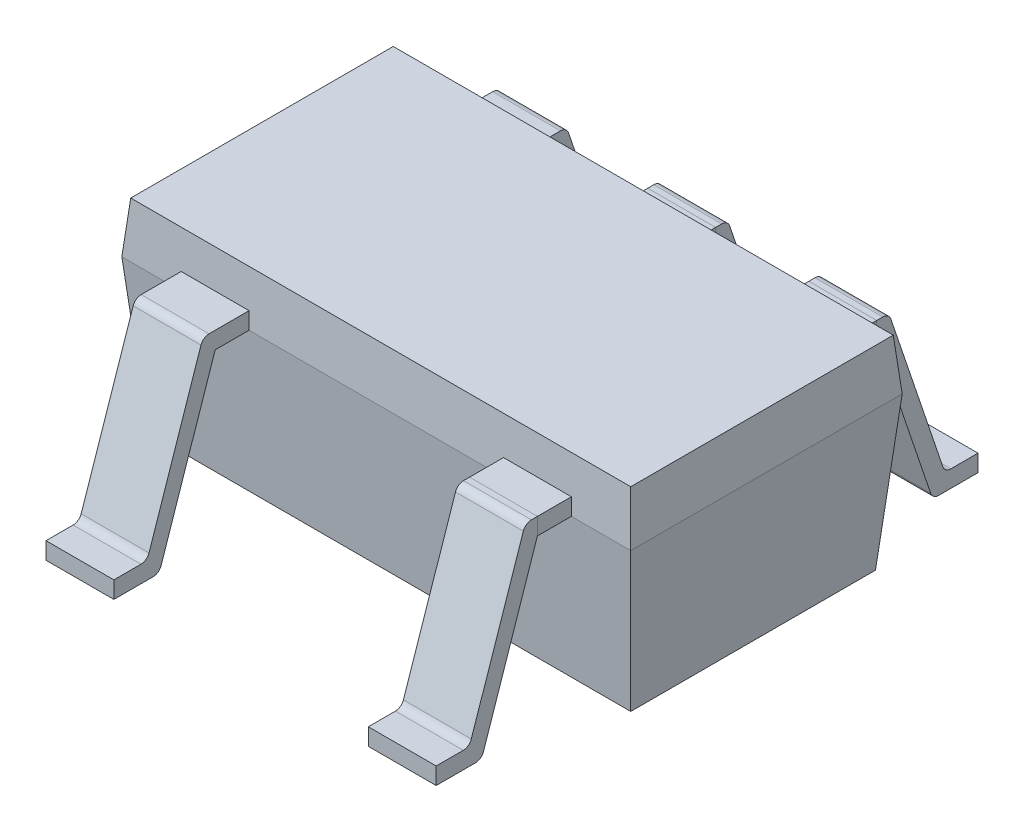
ISO-10303-21;
HEADER;
FILE_DESCRIPTION(('STEP AP214'),'2;1');
FILE_NAME('part.step','',(''),(''),'','','');
FILE_SCHEMA(('AUTOMOTIVE_DESIGN { 1 0 10303 214 1 1 1 1 }'));
ENDSEC;
DATA;
#1=APPLICATION_CONTEXT('core data for automotive mechanical design processes');
#2=APPLICATION_PROTOCOL_DEFINITION('international standard','automotive_design',2000,#1);
#3=PRODUCT_CONTEXT('',#1,'mechanical');
#4=PRODUCT('Part','Part','',(#3));
#5=PRODUCT_RELATED_PRODUCT_CATEGORY('part','',(#4));
#6=PRODUCT_DEFINITION_FORMATION('','',#4);
#7=PRODUCT_DEFINITION_CONTEXT('part definition',#1,'design');
#8=PRODUCT_DEFINITION('design','',#6,#7);
#9=PRODUCT_DEFINITION_SHAPE('','',#8);
#10=(LENGTH_UNIT() NAMED_UNIT(*) SI_UNIT(.MILLI.,.METRE.));
#11=(NAMED_UNIT(*) PLANE_ANGLE_UNIT() SI_UNIT($,.RADIAN.));
#12=(NAMED_UNIT(*) SI_UNIT($,.STERADIAN.) SOLID_ANGLE_UNIT());
#13=UNCERTAINTY_MEASURE_WITH_UNIT(LENGTH_MEASURE(1.E-05),#10,'distance_accuracy_value','');
#14=(GEOMETRIC_REPRESENTATION_CONTEXT(3) GLOBAL_UNCERTAINTY_ASSIGNED_CONTEXT((#13)) GLOBAL_UNIT_ASSIGNED_CONTEXT((#10,
#11,#12)) REPRESENTATION_CONTEXT('',''));
#15=CARTESIAN_POINT('',(0.,0.,0.));
#16=DIRECTION('',(0.,0.,1.));
#17=DIRECTION('',(1.,0.,0.));
#18=AXIS2_PLACEMENT_3D('',#15,#16,#17);
#19=CARTESIAN_POINT('',(-21.4428659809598,-0.0758305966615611,-9.71401697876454));
#20=DIRECTION('',(0.,-1.,0.));
#21=DIRECTION('',(0.,0.,-1.));
#22=AXIS2_PLACEMENT_3D('',#19,#20,#21);
#23=PLANE('',#22);
#24=DIRECTION('',(0.,0.,1.));
#25=VECTOR('',#24,1.);
#26=CARTESIAN_POINT('',(-21.4428659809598,-0.0758305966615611,-10.5110116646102));
#27=LINE('',#26,#25);
#28=CARTESIAN_POINT('',(-21.4428659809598,-0.0758305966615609,-9.94546709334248));
#29=VERTEX_POINT('',#28);
#30=CARTESIAN_POINT('',(-21.4428659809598,-0.0758305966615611,-9.71401697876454));
#31=VERTEX_POINT('',#30);
#32=EDGE_CURVE('P0_E168',#29,#31,#27,.T.);
#33=ORIENTED_EDGE('',*,*,#32,.F.);
#34=DIRECTION('',(1.,0.,0.));
#35=VECTOR('',#34,1.);
#36=CARTESIAN_POINT('',(-21.4428659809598,-0.0758305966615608,-9.94546709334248));
#37=LINE('',#36,#35);
#38=CARTESIAN_POINT('',(-21.0428659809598,-0.075830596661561,-9.94546709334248));
#39=VERTEX_POINT('',#38);
#40=EDGE_CURVE('P0_E174',#39,#29,#37,.F.);
#41=ORIENTED_EDGE('',*,*,#40,.F.);
#42=DIRECTION('',(0.,0.,-1.));
#43=VECTOR('',#42,1.);
#44=CARTESIAN_POINT('',(-21.0428659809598,-0.0758305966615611,-10.5110116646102));
#45=LINE('',#44,#43);
#46=CARTESIAN_POINT('',(-21.0428659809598,-0.0758305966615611,-9.71401697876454));
#47=VERTEX_POINT('',#46);
#48=EDGE_CURVE('P0_E181',#47,#39,#45,.T.);
#49=ORIENTED_EDGE('',*,*,#48,.F.);
#50=DIRECTION('',(1.,0.,0.));
#51=VECTOR('',#50,1.);
#52=CARTESIAN_POINT('',(-21.4428659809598,-0.0758305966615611,-9.71401697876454));
#53=LINE('',#52,#51);
#54=EDGE_CURVE('P0_E161',#31,#47,#53,.T.);
#55=ORIENTED_EDGE('',*,*,#54,.F.);
#56=EDGE_LOOP('',(#33,#41,#49,#55));
#57=FACE_BOUND('',#56,.T.);
#58=ADVANCED_FACE('P0_F19',(#57),#23,.T.);
#59=CARTESIAN_POINT('',(-21.4428659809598,0.0241694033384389,-9.71401697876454));
#60=DIRECTION('',(0.,0.,1.));
#61=DIRECTION('',(1.,0.,0.));
#62=AXIS2_PLACEMENT_3D('',#59,#60,#61);
#63=PLANE('',#62);
#64=DIRECTION('',(0.,1.,0.));
#65=VECTOR('',#64,1.);
#66=CARTESIAN_POINT('',(-21.4428659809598,1.,-9.71401697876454));
#67=LINE('',#66,#65);
#68=CARTESIAN_POINT('',(-21.4428659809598,0.0241694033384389,-9.71401697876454));
#69=VERTEX_POINT('',#68);
#70=EDGE_CURVE('P0_E164',#31,#69,#67,.T.);
#71=ORIENTED_EDGE('',*,*,#70,.F.);
#72=ORIENTED_EDGE('',*,*,#54,.T.);
#73=DIRECTION('',(0.,1.,0.));
#74=VECTOR('',#73,1.);
#75=CARTESIAN_POINT('',(-21.0428659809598,1.,-9.71401697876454));
#76=LINE('',#75,#74);
#77=CARTESIAN_POINT('',(-21.0428659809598,0.0241694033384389,-9.71401697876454));
#78=VERTEX_POINT('',#77);
#79=EDGE_CURVE('P0_E178',#78,#47,#76,.F.);
#80=ORIENTED_EDGE('',*,*,#79,.F.);
#81=DIRECTION('',(1.,0.,0.));
#82=VECTOR('',#81,1.);
#83=CARTESIAN_POINT('',(-21.4428659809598,0.0241694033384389,-9.71401697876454));
#84=LINE('',#83,#82);
#85=EDGE_CURVE('P0_E159',#69,#78,#84,.T.);
#86=ORIENTED_EDGE('',*,*,#85,.F.);
#87=EDGE_LOOP('',(#71,#72,#80,#86));
#88=FACE_BOUND('',#87,.T.);
#89=ADVANCED_FACE('P0_F251',(#88),#63,.T.);
#90=CARTESIAN_POINT('',(-21.4428659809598,0.0241694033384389,-9.71401697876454));
#91=DIRECTION('',(0.,1.,0.));
#92=DIRECTION('',(0.,0.,1.));
#93=AXIS2_PLACEMENT_3D('',#90,#91,#92);
#94=PLANE('',#93);
#95=DIRECTION('',(0.,0.,1.));
#96=VECTOR('',#95,1.);
#97=CARTESIAN_POINT('',(-21.4428659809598,0.0241694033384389,-10.5110116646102));
#98=LINE('',#97,#96);
#99=CARTESIAN_POINT('',(-21.4428659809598,0.0241694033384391,-9.87369742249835));
#100=VERTEX_POINT('',#99);
#101=EDGE_CURVE('P0_E167',#69,#100,#98,.F.);
#102=ORIENTED_EDGE('',*,*,#101,.F.);
#103=ORIENTED_EDGE('',*,*,#85,.T.);
#104=DIRECTION('',(0.,0.,-1.));
#105=VECTOR('',#104,1.);
#106=CARTESIAN_POINT('',(-21.0428659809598,0.0241694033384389,-10.5110116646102));
#107=LINE('',#106,#105);
#108=CARTESIAN_POINT('',(-21.0428659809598,0.024169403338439,-9.87369742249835));
#109=VERTEX_POINT('',#108);
#110=EDGE_CURVE('P0_E182',#109,#78,#107,.F.);
#111=ORIENTED_EDGE('',*,*,#110,.F.);
#112=DIRECTION('',(1.,0.,0.));
#113=VECTOR('',#112,1.);
#114=CARTESIAN_POINT('',(-21.4428659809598,0.0241694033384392,-9.87369742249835));
#115=LINE('',#114,#113);
#116=EDGE_CURVE('P0_E157',#109,#100,#115,.F.);
#117=ORIENTED_EDGE('',*,*,#116,.T.);
#118=EDGE_LOOP('',(#102,#103,#111,#117));
#119=FACE_BOUND('',#118,.T.);
#120=ADVANCED_FACE('P0_F255',(#119),#94,.T.);
#121=CARTESIAN_POINT('',(-21.4428659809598,0.0741694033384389,-9.87369742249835));
#122=DIRECTION('',(1.,0.,0.));
#123=DIRECTION('',(0.,0.,-1.));
#124=AXIS2_PLACEMENT_3D('',#121,#122,#123);
#125=CYLINDRICAL_SURFACE('',#124,0.0499999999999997);
#126=DIRECTION('',(1.,0.,0.));
#127=VECTOR('',#126,1.);
#128=CARTESIAN_POINT('',(-21.4428659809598,0.0581666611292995,-9.92106737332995));
#129=LINE('',#128,#127);
#130=CARTESIAN_POINT('',(-21.4428659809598,0.0581666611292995,-9.92106737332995));
#131=VERTEX_POINT('',#130);
#132=CARTESIAN_POINT('',(-21.0428659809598,0.0581666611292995,-9.92106737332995));
#133=VERTEX_POINT('',#132);
#134=EDGE_CURVE('P0_E115',#131,#133,#129,.T.);
#135=ORIENTED_EDGE('',*,*,#134,.F.);
#136=CARTESIAN_POINT('',(-21.4428659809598,0.0741694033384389,-9.87369742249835));
#137=DIRECTION('',(1.,0.,0.));
#138=DIRECTION('',(0.,0.,-1.));
#139=AXIS2_PLACEMENT_3D('',#136,#137,#138);
#140=CIRCLE('',#139,0.0499999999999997);
#141=EDGE_CURVE('P0_E187',#100,#131,#140,.T.);
#142=ORIENTED_EDGE('',*,*,#141,.F.);
#143=ORIENTED_EDGE('',*,*,#116,.F.);
#144=CARTESIAN_POINT('',(-21.0428659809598,0.0741694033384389,-9.87369742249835));
#145=DIRECTION('',(1.,0.,0.));
#146=DIRECTION('',(0.,0.,-1.));
#147=AXIS2_PLACEMENT_3D('',#144,#145,#146);
#148=CIRCLE('',#147,0.0499999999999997);
#149=EDGE_CURVE('P0_E123',#133,#109,#148,.F.);
#150=ORIENTED_EDGE('',*,*,#149,.F.);
#151=EDGE_LOOP('',(#135,#142,#143,#150));
#152=FACE_BOUND('',#151,.T.);
#153=ADVANCED_FACE('P0_F257',(#152),#125,.F.);
#154=CARTESIAN_POINT('',(-21.4428659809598,0.966002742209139,-10.2277568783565));
#155=DIRECTION('',(0.,0.32005484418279,0.947399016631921));
#156=DIRECTION('',(0.,-0.947399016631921,0.32005484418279));
#157=AXIS2_PLACEMENT_3D('',#154,#155,#156);
#158=PLANE('',#157);
#159=DIRECTION('',(0.,0.947399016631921,-0.32005484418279));
#160=VECTOR('',#159,1.);
#161=CARTESIAN_POINT('',(-21.4428659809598,0.0581666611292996,-9.92106737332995));
#162=LINE('',#161,#160);
#163=CARTESIAN_POINT('',(-21.4428659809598,0.966002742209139,-10.2277568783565));
#164=VERTEX_POINT('',#163);
#165=EDGE_CURVE('P0_E186',#131,#164,#162,.T.);
#166=ORIENTED_EDGE('',*,*,#165,.F.);
#167=ORIENTED_EDGE('',*,*,#134,.T.);
#168=DIRECTION('',(0.,-0.947399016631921,0.32005484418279));
#169=VECTOR('',#168,1.);
#170=CARTESIAN_POINT('',(-21.0428659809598,0.966002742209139,-10.2277568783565));
#171=LINE('',#170,#169);
#172=CARTESIAN_POINT('',(-21.0428659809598,0.966002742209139,-10.2277568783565));
#173=VERTEX_POINT('',#172);
#174=EDGE_CURVE('P0_E118',#173,#133,#171,.T.);
#175=ORIENTED_EDGE('',*,*,#174,.F.);
#176=DIRECTION('',(1.,0.,0.));
#177=VECTOR('',#176,1.);
#178=CARTESIAN_POINT('',(-21.4428659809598,0.966002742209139,-10.2277568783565));
#179=LINE('',#178,#177);
#180=EDGE_CURVE('P0_E105',#164,#173,#179,.T.);
#181=ORIENTED_EDGE('',*,*,#180,.F.);
#182=EDGE_LOOP('',(#166,#167,#175,#181));
#183=FACE_BOUND('',#182,.T.);
#184=ADVANCED_FACE('P0_F119',(#183),#158,.T.);
#185=CARTESIAN_POINT('',(-21.4428659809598,0.95,-10.2751268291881));
#186=DIRECTION('',(1.,0.,0.));
#187=DIRECTION('',(0.,0.,-1.));
#188=AXIS2_PLACEMENT_3D('',#185,#186,#187);
#189=CYLINDRICAL_SURFACE('',#188,0.0499999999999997);
#190=CARTESIAN_POINT('',(-21.4428659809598,0.95,-10.2751268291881));
#191=DIRECTION('',(1.,0.,0.));
#192=DIRECTION('',(0.,0.,-1.));
#193=AXIS2_PLACEMENT_3D('',#190,#191,#192);
#194=CIRCLE('',#193,0.0499999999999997);
#195=CARTESIAN_POINT('',(-21.4428659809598,1.,-10.2751268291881));
#196=VERTEX_POINT('',#195);
#197=EDGE_CURVE('P0_E111',#164,#196,#194,.F.);
#198=ORIENTED_EDGE('',*,*,#197,.F.);
#199=ORIENTED_EDGE('',*,*,#180,.T.);
#200=CARTESIAN_POINT('',(-21.0428659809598,0.95,-10.2751268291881));
#201=DIRECTION('',(1.,0.,0.));
#202=DIRECTION('',(0.,0.,-1.));
#203=AXIS2_PLACEMENT_3D('',#200,#201,#202);
#204=CIRCLE('',#203,0.0499999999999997);
#205=CARTESIAN_POINT('',(-21.0428659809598,1.,-10.2751268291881));
#206=VERTEX_POINT('',#205);
#207=EDGE_CURVE('P0_E22',#206,#173,#204,.T.);
#208=ORIENTED_EDGE('',*,*,#207,.F.);
#209=DIRECTION('',(1.,0.,0.));
#210=VECTOR('',#209,1.);
#211=CARTESIAN_POINT('',(0.,1.,-10.2751268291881));
#212=LINE('',#211,#210);
#213=EDGE_CURVE('P0_E100',#196,#206,#212,.T.);
#214=ORIENTED_EDGE('',*,*,#213,.F.);
#215=EDGE_LOOP('',(#198,#199,#208,#214));
#216=FACE_BOUND('',#215,.T.);
#217=ADVANCED_FACE('P0_F107',(#216),#189,.T.);
#218=CARTESIAN_POINT('',(0.,1.,0.));
#219=DIRECTION('',(0.,1.,0.));
#220=DIRECTION('',(0.,0.,1.));
#221=AXIS2_PLACEMENT_3D('',#218,#219,#220);
#222=PLANE('',#221);
#223=DIRECTION('',(0.,0.,-1.));
#224=VECTOR('',#223,1.);
#225=CARTESIAN_POINT('',(-21.0428659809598,1.,-10.5110116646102));
#226=LINE('',#225,#224);
#227=CARTESIAN_POINT('',(-21.0428659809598,1.,-10.5110116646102));
#228=VERTEX_POINT('',#227);
#229=EDGE_CURVE('P0_E127',#228,#206,#226,.F.);
#230=ORIENTED_EDGE('',*,*,#229,.F.);
#231=DIRECTION('',(-1.,0.,0.));
#232=VECTOR('',#231,1.);
#233=CARTESIAN_POINT('',(-21.4428659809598,1.,-10.5110116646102));
#234=LINE('',#233,#232);
#235=CARTESIAN_POINT('',(-21.4428659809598,1.,-10.5110116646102));
#236=VERTEX_POINT('',#235);
#237=EDGE_CURVE('P0_E130',#236,#228,#234,.F.);
#238=ORIENTED_EDGE('',*,*,#237,.F.);
#239=DIRECTION('',(0.,0.,1.));
#240=VECTOR('',#239,1.);
#241=CARTESIAN_POINT('',(-21.4428659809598,1.,-10.5110116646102));
#242=LINE('',#241,#240);
#243=EDGE_CURVE('P0_E144',#196,#236,#242,.F.);
#244=ORIENTED_EDGE('',*,*,#243,.F.);
#245=ORIENTED_EDGE('',*,*,#213,.T.);
#246=EDGE_LOOP('',(#230,#238,#244,#245));
#247=FACE_BOUND('',#246,.T.);
#248=ADVANCED_FACE('P0_F232',(#247),#222,.T.);
#249=CARTESIAN_POINT('',(-21.4428659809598,1.,-10.5110116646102));
#250=DIRECTION('',(0.,0.,-1.));
#251=DIRECTION('',(-1.,0.,0.));
#252=AXIS2_PLACEMENT_3D('',#249,#250,#251);
#253=PLANE('',#252);
#254=ORIENTED_EDGE('',*,*,#237,.T.);
#255=DIRECTION('',(0.,1.,0.));
#256=VECTOR('',#255,1.);
#257=CARTESIAN_POINT('',(-21.0428659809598,1.,-10.5110116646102));
#258=LINE('',#257,#256);
#259=CARTESIAN_POINT('',(-21.0428659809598,0.9,-10.5110116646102));
#260=VERTEX_POINT('',#259);
#261=EDGE_CURVE('P0_E128',#260,#228,#258,.T.);
#262=ORIENTED_EDGE('',*,*,#261,.F.);
#263=DIRECTION('',(1.,0.,0.));
#264=VECTOR('',#263,1.);
#265=CARTESIAN_POINT('',(0.,0.9,-10.5110116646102));
#266=LINE('',#265,#264);
#267=CARTESIAN_POINT('',(-21.4428659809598,0.9,-10.5110116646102));
#268=VERTEX_POINT('',#267);
#269=EDGE_CURVE('P0_E139',#260,#268,#266,.F.);
#270=ORIENTED_EDGE('',*,*,#269,.T.);
#271=DIRECTION('',(0.,1.,0.));
#272=VECTOR('',#271,1.);
#273=CARTESIAN_POINT('',(-21.4428659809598,1.,-10.5110116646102));
#274=LINE('',#273,#272);
#275=EDGE_CURVE('P0_E140',#236,#268,#274,.F.);
#276=ORIENTED_EDGE('',*,*,#275,.F.);
#277=EDGE_LOOP('',(#254,#262,#270,#276));
#278=FACE_BOUND('',#277,.T.);
#279=ADVANCED_FACE('P0_F234',(#278),#253,.T.);
#280=CARTESIAN_POINT('',(-21.0428659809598,1.,-10.5110116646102));
#281=DIRECTION('',(1.,0.,0.));
#282=DIRECTION('',(0.,0.,-1.));
#283=AXIS2_PLACEMENT_3D('',#280,#281,#282);
#284=PLANE('',#283);
#285=CARTESIAN_POINT('',(-21.0428659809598,-0.0258305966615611,-9.94546709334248));
#286=DIRECTION('',(1.,0.,0.));
#287=DIRECTION('',(0.,0.,-1.));
#288=AXIS2_PLACEMENT_3D('',#285,#286,#287);
#289=CIRCLE('',#288,0.0499999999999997);
#290=CARTESIAN_POINT('',(-21.0428659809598,-0.0418333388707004,-9.99283704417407));
#291=VERTEX_POINT('',#290);
#292=EDGE_CURVE('P0_E177',#291,#39,#289,.F.);
#293=ORIENTED_EDGE('',*,*,#292,.F.);
#294=DIRECTION('',(0.,0.947399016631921,-0.320054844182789));
#295=VECTOR('',#294,1.);
#296=CARTESIAN_POINT('',(-21.0428659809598,0.9,-10.3110116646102));
#297=LINE('',#296,#295);
#298=CARTESIAN_POINT('',(-21.0428659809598,0.9,-10.3110116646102));
#299=VERTEX_POINT('',#298);
#300=EDGE_CURVE('P0_E203',#299,#291,#297,.F.);
#301=ORIENTED_EDGE('',*,*,#300,.F.);
#302=DIRECTION('',(0.,0.,1.));
#303=VECTOR('',#302,1.);
#304=CARTESIAN_POINT('',(-21.0428659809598,0.9,0.));
#305=LINE('',#304,#303);
#306=EDGE_CURVE('P0_E136',#299,#260,#305,.F.);
#307=ORIENTED_EDGE('',*,*,#306,.T.);
#308=ORIENTED_EDGE('',*,*,#261,.T.);
#309=ORIENTED_EDGE('',*,*,#229,.T.);
#310=ORIENTED_EDGE('',*,*,#207,.T.);
#311=ORIENTED_EDGE('',*,*,#174,.T.);
#312=ORIENTED_EDGE('',*,*,#149,.T.);
#313=ORIENTED_EDGE('',*,*,#110,.T.);
#314=ORIENTED_EDGE('',*,*,#79,.T.);
#315=ORIENTED_EDGE('',*,*,#48,.T.);
#316=EDGE_LOOP('',(#293,#301,#307,#308,#309,#310,#311,#312,#313,#314,#315));
#317=FACE_BOUND('',#316,.T.);
#318=ADVANCED_FACE('P0_F125',(#317),#284,.T.);
#319=CARTESIAN_POINT('',(-21.4428659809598,-0.0258305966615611,-9.94546709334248));
#320=DIRECTION('',(1.,0.,0.));
#321=DIRECTION('',(0.,0.,-1.));
#322=AXIS2_PLACEMENT_3D('',#319,#320,#321);
#323=CYLINDRICAL_SURFACE('',#322,0.0499999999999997);
#324=CARTESIAN_POINT('',(-21.4428659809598,-0.0258305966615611,-9.94546709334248));
#325=DIRECTION('',(1.,0.,0.));
#326=DIRECTION('',(0.,0.,-1.));
#327=AXIS2_PLACEMENT_3D('',#324,#325,#326);
#328=CIRCLE('',#327,0.0499999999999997);
#329=CARTESIAN_POINT('',(-21.4428659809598,-0.0418333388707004,-9.99283704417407));
#330=VERTEX_POINT('',#329);
#331=EDGE_CURVE('P0_E176',#330,#29,#328,.F.);
#332=ORIENTED_EDGE('',*,*,#331,.F.);
#333=DIRECTION('',(1.,0.,0.));
#334=VECTOR('',#333,1.);
#335=CARTESIAN_POINT('',(-21.4428659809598,-0.0418333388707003,-9.99283704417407));
#336=LINE('',#335,#334);
#337=EDGE_CURVE('P0_E206',#291,#330,#336,.F.);
#338=ORIENTED_EDGE('',*,*,#337,.F.);
#339=ORIENTED_EDGE('',*,*,#292,.T.);
#340=ORIENTED_EDGE('',*,*,#40,.T.);
#341=EDGE_LOOP('',(#332,#338,#339,#340));
#342=FACE_BOUND('',#341,.T.);
#343=ADVANCED_FACE('P0_F244',(#342),#323,.T.);
#344=CARTESIAN_POINT('',(-21.4428659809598,1.,-10.5110116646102));
#345=DIRECTION('',(-1.,0.,0.));
#346=DIRECTION('',(0.,0.,1.));
#347=AXIS2_PLACEMENT_3D('',#344,#345,#346);
#348=PLANE('',#347);
#349=ORIENTED_EDGE('',*,*,#243,.T.);
#350=ORIENTED_EDGE('',*,*,#275,.T.);
#351=DIRECTION('',(0.,0.,1.));
#352=VECTOR('',#351,1.);
#353=CARTESIAN_POINT('',(-21.4428659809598,0.9,0.));
#354=LINE('',#353,#352);
#355=CARTESIAN_POINT('',(-21.4428659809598,0.9,-10.3110116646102));
#356=VERTEX_POINT('',#355);
#357=EDGE_CURVE('P0_E37',#268,#356,#354,.T.);
#358=ORIENTED_EDGE('',*,*,#357,.T.);
#359=DIRECTION('',(0.,0.947399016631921,-0.320054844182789));
#360=VECTOR('',#359,1.);
#361=CARTESIAN_POINT('',(-21.4428659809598,0.9,-10.3110116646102));
#362=LINE('',#361,#360);
#363=EDGE_CURVE('P0_E28',#330,#356,#362,.T.);
#364=ORIENTED_EDGE('',*,*,#363,.F.);
#365=ORIENTED_EDGE('',*,*,#331,.T.);
#366=ORIENTED_EDGE('',*,*,#32,.T.);
#367=ORIENTED_EDGE('',*,*,#70,.T.);
#368=ORIENTED_EDGE('',*,*,#101,.T.);
#369=ORIENTED_EDGE('',*,*,#141,.T.);
#370=ORIENTED_EDGE('',*,*,#165,.T.);
#371=ORIENTED_EDGE('',*,*,#197,.T.);
#372=EDGE_LOOP('',(#349,#350,#358,#364,#365,#366,#367,#368,#369,#370,#371));
#373=FACE_BOUND('',#372,.T.);
#374=ADVANCED_FACE('P0_F230',(#373),#348,.T.);
#375=CARTESIAN_POINT('',(0.,0.9,0.));
#376=DIRECTION('',(0.,1.,0.));
#377=DIRECTION('',(0.,0.,1.));
#378=AXIS2_PLACEMENT_3D('',#375,#376,#377);
#379=PLANE('',#378);
#380=ORIENTED_EDGE('',*,*,#269,.F.);
#381=ORIENTED_EDGE('',*,*,#306,.F.);
#382=DIRECTION('',(1.,0.,0.));
#383=VECTOR('',#382,1.);
#384=CARTESIAN_POINT('',(-21.4428659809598,0.9,-10.3110116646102));
#385=LINE('',#384,#383);
#386=EDGE_CURVE('P0_E11',#356,#299,#385,.T.);
#387=ORIENTED_EDGE('',*,*,#386,.F.);
#388=ORIENTED_EDGE('',*,*,#357,.F.);
#389=EDGE_LOOP('',(#380,#381,#387,#388));
#390=FACE_BOUND('',#389,.T.);
#391=ADVANCED_FACE('P0_F238',(#390),#379,.F.);
#392=CARTESIAN_POINT('',(-21.4428659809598,0.9,-10.3110116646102));
#393=DIRECTION('',(0.,-0.320054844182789,-0.947399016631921));
#394=DIRECTION('',(0.,0.947399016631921,-0.320054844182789));
#395=AXIS2_PLACEMENT_3D('',#392,#393,#394);
#396=PLANE('',#395);
#397=ORIENTED_EDGE('',*,*,#363,.T.);
#398=ORIENTED_EDGE('',*,*,#386,.T.);
#399=ORIENTED_EDGE('',*,*,#300,.T.);
#400=ORIENTED_EDGE('',*,*,#337,.T.);
#401=EDGE_LOOP('',(#397,#398,#399,#400));
#402=FACE_BOUND('',#401,.T.);
#403=ADVANCED_FACE('P0_F240',(#402),#396,.T.);
#404=CLOSED_SHELL('',(#58,#89,#120,#153,#184,#217,#248,#279,#318,#343,#374,#391,#403));
#405=MANIFOLD_SOLID_BREP('P0_B1',#404);
#406=CARTESIAN_POINT('',(-19.5428659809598,1.,-12.3110116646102));
#407=DIRECTION('',(0.,1.,0.));
#408=DIRECTION('',(0.,0.,1.));
#409=AXIS2_PLACEMENT_3D('',#406,#407,#408);
#410=PLANE('',#409);
#411=DIRECTION('',(0.,0.,1.));
#412=VECTOR('',#411,1.);
#413=CARTESIAN_POINT('',(-19.5428659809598,1.,-12.6765562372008));
#414=LINE('',#413,#412);
#415=CARTESIAN_POINT('',(-19.5428659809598,1.,-12.3110116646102));
#416=VERTEX_POINT('',#415);
#417=CARTESIAN_POINT('',(-19.5428659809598,1.,-12.3468964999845));
#418=VERTEX_POINT('',#417);
#419=EDGE_CURVE('P1_E161',#416,#418,#414,.F.);
#420=ORIENTED_EDGE('',*,*,#419,.F.);
#421=DIRECTION('',(1.,0.,0.));
#422=VECTOR('',#421,1.);
#423=CARTESIAN_POINT('',(-19.5428659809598,1.,-12.3110116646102));
#424=LINE('',#423,#422);
#425=CARTESIAN_POINT('',(-19.1428659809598,1.,-12.3110116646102));
#426=VERTEX_POINT('',#425);
#427=EDGE_CURVE('P1_E140',#426,#416,#424,.F.);
#428=ORIENTED_EDGE('',*,*,#427,.F.);
#429=DIRECTION('',(0.,0.,1.));
#430=VECTOR('',#429,1.);
#431=CARTESIAN_POINT('',(-19.1428659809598,1.,-12.6765562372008));
#432=LINE('',#431,#430);
#433=CARTESIAN_POINT('',(-19.1428659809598,1.,-12.3468964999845));
#434=VERTEX_POINT('',#433);
#435=EDGE_CURVE('P1_E79',#426,#434,#432,.F.);
#436=ORIENTED_EDGE('',*,*,#435,.T.);
#437=DIRECTION('',(1.,0.,0.));
#438=VECTOR('',#437,1.);
#439=CARTESIAN_POINT('',(-19.5428659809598,1.,-12.3468964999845));
#440=LINE('',#439,#438);
#441=EDGE_CURVE('P1_E89',#418,#434,#440,.T.);
#442=ORIENTED_EDGE('',*,*,#441,.F.);
#443=EDGE_LOOP('',(#420,#428,#436,#442));
#444=FACE_BOUND('',#443,.T.);
#445=ADVANCED_FACE('P1_F19',(#444),#410,.T.);
#446=CARTESIAN_POINT('',(-19.5428659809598,0.95,-12.3468964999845));
#447=DIRECTION('',(1.,0.,0.));
#448=DIRECTION('',(0.,0.,-1.));
#449=AXIS2_PLACEMENT_3D('',#446,#447,#448);
#450=CYLINDRICAL_SURFACE('',#449,0.0499999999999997);
#451=CARTESIAN_POINT('',(-19.5428659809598,0.95,-12.3468964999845));
#452=DIRECTION('',(1.,0.,0.));
#453=DIRECTION('',(0.,0.,-1.));
#454=AXIS2_PLACEMENT_3D('',#451,#452,#453);
#455=CIRCLE('',#454,0.0499999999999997);
#456=CARTESIAN_POINT('',(-19.5428659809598,0.966002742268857,-12.3942664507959));
#457=VERTEX_POINT('',#456);
#458=EDGE_CURVE('P1_E160',#418,#457,#455,.F.);
#459=ORIENTED_EDGE('',*,*,#458,.F.);
#460=ORIENTED_EDGE('',*,*,#441,.T.);
#461=CARTESIAN_POINT('',(-19.1428659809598,0.95,-12.3468964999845));
#462=DIRECTION('',(1.,0.,0.));
#463=DIRECTION('',(0.,0.,-1.));
#464=AXIS2_PLACEMENT_3D('',#461,#462,#463);
#465=CIRCLE('',#464,0.0499999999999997);
#466=CARTESIAN_POINT('',(-19.1428659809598,0.966002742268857,-12.3942664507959));
#467=VERTEX_POINT('',#466);
#468=EDGE_CURVE('P1_E22',#434,#467,#465,.F.);
#469=ORIENTED_EDGE('',*,*,#468,.T.);
#470=DIRECTION('',(1.,0.,0.));
#471=VECTOR('',#470,1.);
#472=CARTESIAN_POINT('',(-19.5428659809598,0.966002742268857,-12.3942664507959));
#473=LINE('',#472,#471);
#474=EDGE_CURVE('P1_E87',#457,#467,#473,.T.);
#475=ORIENTED_EDGE('',*,*,#474,.F.);
#476=EDGE_LOOP('',(#459,#460,#469,#475));
#477=FACE_BOUND('',#476,.T.);
#478=ADVANCED_FACE('P1_F86',(#477),#450,.T.);
#479=CARTESIAN_POINT('',(-19.5428659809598,0.966002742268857,-12.3942664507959));
#480=DIRECTION('',(0.,0.320054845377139,-0.94739901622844));
#481=DIRECTION('',(0.,0.94739901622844,0.320054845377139));
#482=AXIS2_PLACEMENT_3D('',#479,#480,#481);
#483=PLANE('',#482);
#484=DIRECTION('',(0.,-0.94739901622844,-0.320054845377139));
#485=VECTOR('',#484,1.);
#486=CARTESIAN_POINT('',(-19.5428659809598,0.966002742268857,-12.3942664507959));
#487=LINE('',#486,#485);
#488=CARTESIAN_POINT('',(-19.5428659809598,0.0581666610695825,-12.700955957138));
#489=VERTEX_POINT('',#488);
#490=EDGE_CURVE('P1_E97',#457,#489,#487,.T.);
#491=ORIENTED_EDGE('',*,*,#490,.F.);
#492=ORIENTED_EDGE('',*,*,#474,.T.);
#493=DIRECTION('',(0.,-0.94739901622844,-0.320054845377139));
#494=VECTOR('',#493,1.);
#495=CARTESIAN_POINT('',(-19.1428659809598,0.966002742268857,-12.3942664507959));
#496=LINE('',#495,#494);
#497=CARTESIAN_POINT('',(-19.1428659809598,0.0581666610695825,-12.700955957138));
#498=VERTEX_POINT('',#497);
#499=EDGE_CURVE('P1_E92',#467,#498,#496,.T.);
#500=ORIENTED_EDGE('',*,*,#499,.T.);
#501=DIRECTION('',(1.,0.,0.));
#502=VECTOR('',#501,1.);
#503=CARTESIAN_POINT('',(-19.5428659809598,0.0581666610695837,-12.700955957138));
#504=LINE('',#503,#502);
#505=EDGE_CURVE('P1_E99',#498,#489,#504,.F.);
#506=ORIENTED_EDGE('',*,*,#505,.T.);
#507=EDGE_LOOP('',(#491,#492,#500,#506));
#508=FACE_BOUND('',#507,.T.);
#509=ADVANCED_FACE('P1_F94',(#508),#483,.T.);
#510=CARTESIAN_POINT('',(-19.5428659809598,0.0741694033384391,-12.7483259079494));
#511=DIRECTION('',(1.,0.,0.));
#512=DIRECTION('',(0.,0.,-1.));
#513=AXIS2_PLACEMENT_3D('',#510,#511,#512);
#514=CYLINDRICAL_SURFACE('',#513,0.0499999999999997);
#515=DIRECTION('',(1.,0.,0.));
#516=VECTOR('',#515,1.);
#517=CARTESIAN_POINT('',(-19.5428659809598,0.0241694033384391,-12.7483259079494));
#518=LINE('',#517,#516);
#519=CARTESIAN_POINT('',(-19.5428659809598,0.0241694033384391,-12.7483259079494));
#520=VERTEX_POINT('',#519);
#521=CARTESIAN_POINT('',(-19.1428659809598,0.0241694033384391,-12.7483259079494));
#522=VERTEX_POINT('',#521);
#523=EDGE_CURVE('P1_E133',#520,#522,#518,.T.);
#524=ORIENTED_EDGE('',*,*,#523,.F.);
#525=CARTESIAN_POINT('',(-19.5428659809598,0.0741694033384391,-12.7483259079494));
#526=DIRECTION('',(1.,0.,0.));
#527=DIRECTION('',(0.,0.,-1.));
#528=AXIS2_PLACEMENT_3D('',#525,#526,#527);
#529=CIRCLE('',#528,0.0499999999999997);
#530=EDGE_CURVE('P1_E157',#489,#520,#529,.T.);
#531=ORIENTED_EDGE('',*,*,#530,.F.);
#532=ORIENTED_EDGE('',*,*,#505,.F.);
#533=CARTESIAN_POINT('',(-19.1428659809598,0.0741694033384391,-12.7483259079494));
#534=DIRECTION('',(1.,0.,0.));
#535=DIRECTION('',(0.,0.,-1.));
#536=AXIS2_PLACEMENT_3D('',#533,#534,#535);
#537=CIRCLE('',#536,0.0499999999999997);
#538=EDGE_CURVE('P1_E104',#498,#522,#537,.T.);
#539=ORIENTED_EDGE('',*,*,#538,.T.);
#540=EDGE_LOOP('',(#524,#531,#532,#539));
#541=FACE_BOUND('',#540,.T.);
#542=ADVANCED_FACE('P1_F246',(#541),#514,.F.);
#543=CARTESIAN_POINT('',(-19.5428659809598,0.0241694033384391,-12.7483259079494));
#544=DIRECTION('',(0.,1.,0.));
#545=DIRECTION('',(0.,0.,1.));
#546=AXIS2_PLACEMENT_3D('',#543,#544,#545);
#547=PLANE('',#546);
#548=DIRECTION('',(0.,0.,1.));
#549=VECTOR('',#548,1.);
#550=CARTESIAN_POINT('',(-19.5428659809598,0.0241694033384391,-12.6765562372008));
#551=LINE('',#550,#549);
#552=CARTESIAN_POINT('',(-19.5428659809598,0.0241694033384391,-12.9080063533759));
#553=VERTEX_POINT('',#552);
#554=EDGE_CURVE('P1_E128',#520,#553,#551,.F.);
#555=ORIENTED_EDGE('',*,*,#554,.F.);
#556=ORIENTED_EDGE('',*,*,#523,.T.);
#557=DIRECTION('',(0.,0.,1.));
#558=VECTOR('',#557,1.);
#559=CARTESIAN_POINT('',(-19.1428659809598,0.0241694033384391,-12.6765562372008));
#560=LINE('',#559,#558);
#561=CARTESIAN_POINT('',(-19.1428659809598,0.0241694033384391,-12.9080063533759));
#562=VERTEX_POINT('',#561);
#563=EDGE_CURVE('P1_E106',#522,#562,#560,.F.);
#564=ORIENTED_EDGE('',*,*,#563,.T.);
#565=DIRECTION('',(-1.,0.,0.));
#566=VECTOR('',#565,1.);
#567=CARTESIAN_POINT('',(-19.5428659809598,0.0241694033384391,-12.9080063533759));
#568=LINE('',#567,#566);
#569=EDGE_CURVE('P1_E121',#553,#562,#568,.F.);
#570=ORIENTED_EDGE('',*,*,#569,.F.);
#571=EDGE_LOOP('',(#555,#556,#564,#570));
#572=FACE_BOUND('',#571,.T.);
#573=ADVANCED_FACE('P1_F197',(#572),#547,.T.);
#574=CARTESIAN_POINT('',(-19.5428659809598,0.0241694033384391,-12.9080063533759));
#575=DIRECTION('',(0.,0.,-1.));
#576=DIRECTION('',(-1.,0.,0.));
#577=AXIS2_PLACEMENT_3D('',#574,#575,#576);
#578=PLANE('',#577);
#579=DIRECTION('',(0.,1.,0.));
#580=VECTOR('',#579,1.);
#581=CARTESIAN_POINT('',(-19.5428659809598,-0.0258305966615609,-12.9080063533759));
#582=LINE('',#581,#580);
#583=CARTESIAN_POINT('',(-19.5428659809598,-0.0758305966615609,-12.9080063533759));
#584=VERTEX_POINT('',#583);
#585=EDGE_CURVE('P1_E124',#553,#584,#582,.F.);
#586=ORIENTED_EDGE('',*,*,#585,.F.);
#587=ORIENTED_EDGE('',*,*,#569,.T.);
#588=DIRECTION('',(0.,1.,0.));
#589=VECTOR('',#588,1.);
#590=CARTESIAN_POINT('',(-19.1428659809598,-0.0258305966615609,-12.9080063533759));
#591=LINE('',#590,#589);
#592=CARTESIAN_POINT('',(-19.1428659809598,-0.0758305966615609,-12.9080063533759));
#593=VERTEX_POINT('',#592);
#594=EDGE_CURVE('P1_E147',#562,#593,#591,.F.);
#595=ORIENTED_EDGE('',*,*,#594,.T.);
#596=DIRECTION('',(1.,0.,0.));
#597=VECTOR('',#596,1.);
#598=CARTESIAN_POINT('',(-19.5428659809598,-0.0758305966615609,-12.9080063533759));
#599=LINE('',#598,#597);
#600=EDGE_CURVE('P1_E112',#584,#593,#599,.T.);
#601=ORIENTED_EDGE('',*,*,#600,.F.);
#602=EDGE_LOOP('',(#586,#587,#595,#601));
#603=FACE_BOUND('',#602,.T.);
#604=ADVANCED_FACE('P1_F202',(#603),#578,.T.);
#605=CARTESIAN_POINT('',(-19.5428659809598,-0.0758305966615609,-12.6765562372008));
#606=DIRECTION('',(0.,-1.,0.));
#607=DIRECTION('',(0.,0.,-1.));
#608=AXIS2_PLACEMENT_3D('',#605,#606,#607);
#609=PLANE('',#608);
#610=DIRECTION('',(0.,0.,1.));
#611=VECTOR('',#610,1.);
#612=CARTESIAN_POINT('',(-19.5428659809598,-0.0758305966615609,-12.6765562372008));
#613=LINE('',#612,#611);
#614=CARTESIAN_POINT('',(-19.5428659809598,-0.0758305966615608,-12.6765562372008));
#615=VERTEX_POINT('',#614);
#616=EDGE_CURVE('P1_E127',#584,#615,#613,.T.);
#617=ORIENTED_EDGE('',*,*,#616,.F.);
#618=ORIENTED_EDGE('',*,*,#600,.T.);
#619=DIRECTION('',(0.,0.,1.));
#620=VECTOR('',#619,1.);
#621=CARTESIAN_POINT('',(-19.1428659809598,-0.0758305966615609,-12.6765562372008));
#622=LINE('',#621,#620);
#623=CARTESIAN_POINT('',(-19.1428659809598,-0.0758305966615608,-12.6765562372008));
#624=VERTEX_POINT('',#623);
#625=EDGE_CURVE('P1_E150',#593,#624,#622,.T.);
#626=ORIENTED_EDGE('',*,*,#625,.T.);
#627=DIRECTION('',(1.,0.,0.));
#628=VECTOR('',#627,1.);
#629=CARTESIAN_POINT('',(-19.5428659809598,-0.0758305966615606,-12.6765562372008));
#630=LINE('',#629,#628);
#631=EDGE_CURVE('P1_E115',#615,#624,#630,.T.);
#632=ORIENTED_EDGE('',*,*,#631,.F.);
#633=EDGE_LOOP('',(#617,#618,#626,#632));
#634=FACE_BOUND('',#633,.T.);
#635=ADVANCED_FACE('P1_F212',(#634),#609,.T.);
#636=CARTESIAN_POINT('',(-19.1428659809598,-0.0258305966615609,-12.6765562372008));
#637=DIRECTION('',(-1.,0.,0.));
#638=DIRECTION('',(0.,0.,1.));
#639=AXIS2_PLACEMENT_3D('',#636,#637,#638);
#640=PLANE('',#639);
#641=DIRECTION('',(0.,-0.94739901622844,-0.320054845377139));
#642=VECTOR('',#641,1.);
#643=CARTESIAN_POINT('',(-19.1428659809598,0.9,-12.3110116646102));
#644=LINE('',#643,#642);
#645=CARTESIAN_POINT('',(-19.1428659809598,-0.0418333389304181,-12.6291862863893));
#646=VERTEX_POINT('',#645);
#647=CARTESIAN_POINT('',(-19.1428659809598,0.9,-12.3110116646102));
#648=VERTEX_POINT('',#647);
#649=EDGE_CURVE('P1_E118',#646,#648,#644,.F.);
#650=ORIENTED_EDGE('',*,*,#649,.F.);
#651=CARTESIAN_POINT('',(-19.1428659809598,-0.0258305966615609,-12.6765562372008));
#652=DIRECTION('',(1.,0.,0.));
#653=DIRECTION('',(0.,0.,-1.));
#654=AXIS2_PLACEMENT_3D('',#651,#652,#653);
#655=CIRCLE('',#654,0.0499999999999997);
#656=EDGE_CURVE('P1_E154',#624,#646,#655,.F.);
#657=ORIENTED_EDGE('',*,*,#656,.F.);
#658=ORIENTED_EDGE('',*,*,#625,.F.);
#659=ORIENTED_EDGE('',*,*,#594,.F.);
#660=ORIENTED_EDGE('',*,*,#563,.F.);
#661=ORIENTED_EDGE('',*,*,#538,.F.);
#662=ORIENTED_EDGE('',*,*,#499,.F.);
#663=ORIENTED_EDGE('',*,*,#468,.F.);
#664=ORIENTED_EDGE('',*,*,#435,.F.);
#665=DIRECTION('',(0.,1.,0.));
#666=VECTOR('',#665,1.);
#667=CARTESIAN_POINT('',(-19.1428659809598,1.,-12.3110116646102));
#668=LINE('',#667,#666);
#669=EDGE_CURVE('P1_E144',#648,#426,#668,.T.);
#670=ORIENTED_EDGE('',*,*,#669,.F.);
#671=EDGE_LOOP('',(#650,#657,#658,#659,#660,#661,#662,#663,#664,#670));
#672=FACE_BOUND('',#671,.T.);
#673=ADVANCED_FACE('P1_F102',(#672),#640,.F.);
#674=CARTESIAN_POINT('',(-19.5428659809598,1.,-12.3110116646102));
#675=DIRECTION('',(0.,0.,1.));
#676=DIRECTION('',(1.,0.,0.));
#677=AXIS2_PLACEMENT_3D('',#674,#675,#676);
#678=PLANE('',#677);
#679=DIRECTION('',(0.,1.,0.));
#680=VECTOR('',#679,1.);
#681=CARTESIAN_POINT('',(-19.5428659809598,-0.0258305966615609,-12.3110116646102));
#682=LINE('',#681,#680);
#683=CARTESIAN_POINT('',(-19.5428659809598,0.9,-12.3110116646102));
#684=VERTEX_POINT('',#683);
#685=EDGE_CURVE('P1_E143',#684,#416,#682,.T.);
#686=ORIENTED_EDGE('',*,*,#685,.F.);
#687=DIRECTION('',(1.,0.,0.));
#688=VECTOR('',#687,1.);
#689=CARTESIAN_POINT('',(-19.5428659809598,0.9,-12.3110116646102));
#690=LINE('',#689,#688);
#691=EDGE_CURVE('P1_E174',#648,#684,#690,.F.);
#692=ORIENTED_EDGE('',*,*,#691,.F.);
#693=ORIENTED_EDGE('',*,*,#669,.T.);
#694=ORIENTED_EDGE('',*,*,#427,.T.);
#695=EDGE_LOOP('',(#686,#692,#693,#694));
#696=FACE_BOUND('',#695,.T.);
#697=ADVANCED_FACE('P1_F219',(#696),#678,.T.);
#698=CARTESIAN_POINT('',(-19.5428659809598,-0.0258305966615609,-12.6765562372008));
#699=DIRECTION('',(-1.,0.,0.));
#700=DIRECTION('',(0.,0.,1.));
#701=AXIS2_PLACEMENT_3D('',#698,#699,#700);
#702=PLANE('',#701);
#703=CARTESIAN_POINT('',(-19.5428659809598,-0.0258305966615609,-12.6765562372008));
#704=DIRECTION('',(1.,0.,0.));
#705=DIRECTION('',(0.,0.,-1.));
#706=AXIS2_PLACEMENT_3D('',#703,#704,#705);
#707=CIRCLE('',#706,0.0499999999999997);
#708=CARTESIAN_POINT('',(-19.5428659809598,-0.0418333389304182,-12.6291862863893));
#709=VERTEX_POINT('',#708);
#710=EDGE_CURVE('P1_E37',#709,#615,#707,.T.);
#711=ORIENTED_EDGE('',*,*,#710,.F.);
#712=DIRECTION('',(0.,-0.94739901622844,-0.320054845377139));
#713=VECTOR('',#712,1.);
#714=CARTESIAN_POINT('',(-19.5428659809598,0.9,-12.3110116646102));
#715=LINE('',#714,#713);
#716=EDGE_CURVE('P1_E28',#684,#709,#715,.T.);
#717=ORIENTED_EDGE('',*,*,#716,.F.);
#718=ORIENTED_EDGE('',*,*,#685,.T.);
#719=ORIENTED_EDGE('',*,*,#419,.T.);
#720=ORIENTED_EDGE('',*,*,#458,.T.);
#721=ORIENTED_EDGE('',*,*,#490,.T.);
#722=ORIENTED_EDGE('',*,*,#530,.T.);
#723=ORIENTED_EDGE('',*,*,#554,.T.);
#724=ORIENTED_EDGE('',*,*,#585,.T.);
#725=ORIENTED_EDGE('',*,*,#616,.T.);
#726=EDGE_LOOP('',(#711,#717,#718,#719,#720,#721,#722,#723,#724,#725));
#727=FACE_BOUND('',#726,.T.);
#728=ADVANCED_FACE('P1_F221',(#727),#702,.T.);
#729=CARTESIAN_POINT('',(-19.5428659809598,-0.0258305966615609,-12.6765562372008));
#730=DIRECTION('',(1.,0.,0.));
#731=DIRECTION('',(0.,0.,-1.));
#732=AXIS2_PLACEMENT_3D('',#729,#730,#731);
#733=CYLINDRICAL_SURFACE('',#732,0.0499999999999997);
#734=ORIENTED_EDGE('',*,*,#710,.T.);
#735=ORIENTED_EDGE('',*,*,#631,.T.);
#736=ORIENTED_EDGE('',*,*,#656,.T.);
#737=DIRECTION('',(1.,0.,0.));
#738=VECTOR('',#737,1.);
#739=CARTESIAN_POINT('',(-19.5428659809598,-0.0418333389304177,-12.6291862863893));
#740=LINE('',#739,#738);
#741=EDGE_CURVE('P1_E11',#709,#646,#740,.T.);
#742=ORIENTED_EDGE('',*,*,#741,.F.);
#743=EDGE_LOOP('',(#734,#735,#736,#742));
#744=FACE_BOUND('',#743,.T.);
#745=ADVANCED_FACE('P1_F225',(#744),#733,.T.);
#746=CARTESIAN_POINT('',(-19.5428659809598,0.9,-12.3110116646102));
#747=DIRECTION('',(0.,-0.320054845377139,0.94739901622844));
#748=DIRECTION('',(0.,-0.94739901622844,-0.320054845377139));
#749=AXIS2_PLACEMENT_3D('',#746,#747,#748);
#750=PLANE('',#749);
#751=ORIENTED_EDGE('',*,*,#716,.T.);
#752=ORIENTED_EDGE('',*,*,#741,.T.);
#753=ORIENTED_EDGE('',*,*,#649,.T.);
#754=ORIENTED_EDGE('',*,*,#691,.T.);
#755=EDGE_LOOP('',(#751,#752,#753,#754));
#756=FACE_BOUND('',#755,.T.);
#757=ADVANCED_FACE('P1_F223',(#756),#750,.T.);
#758=CLOSED_SHELL('',(#445,#478,#509,#542,#573,#604,#635,#673,#697,#728,#745,#757));
#759=MANIFOLD_SOLID_BREP('P1_B1',#758);
#760=CARTESIAN_POINT('',(0.,0.9,0.));
#761=DIRECTION('',(0.,-1.,0.));
#762=DIRECTION('',(0.,0.,-1.));
#763=AXIS2_PLACEMENT_3D('',#760,#761,#762);
#764=PLANE('',#763);
#765=DIRECTION('',(-1.,0.,0.));
#766=VECTOR('',#765,1.);
#767=CARTESIAN_POINT('',(-19.5428659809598,0.9,-10.5110116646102));
#768=LINE('',#767,#766);
#769=CARTESIAN_POINT('',(-19.1428659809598,0.9,-10.5110116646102));
#770=VERTEX_POINT('',#769);
#771=CARTESIAN_POINT('',(-19.5428659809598,0.9,-10.5110116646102));
#772=VERTEX_POINT('',#771);
#773=EDGE_CURVE('P2_E59',#770,#772,#768,.T.);
#774=ORIENTED_EDGE('',*,*,#773,.F.);
#775=DIRECTION('',(0.,0.,-1.));
#776=VECTOR('',#775,1.);
#777=CARTESIAN_POINT('',(-19.1428659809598,0.9,-10.5110116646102));
#778=LINE('',#777,#776);
#779=CARTESIAN_POINT('',(-19.1428659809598,0.9,-10.3110116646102));
#780=VERTEX_POINT('',#779);
#781=EDGE_CURVE('P2_E54',#780,#770,#778,.T.);
#782=ORIENTED_EDGE('',*,*,#781,.F.);
#783=DIRECTION('',(1.,0.,0.));
#784=VECTOR('',#783,1.);
#785=CARTESIAN_POINT('',(-19.5428659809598,0.9,-10.3110116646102));
#786=LINE('',#785,#784);
#787=CARTESIAN_POINT('',(-19.5428659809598,0.9,-10.3110116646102));
#788=VERTEX_POINT('',#787);
#789=EDGE_CURVE('P2_E69',#788,#780,#786,.T.);
#790=ORIENTED_EDGE('',*,*,#789,.F.);
#791=DIRECTION('',(0.,0.,1.));
#792=VECTOR('',#791,1.);
#793=CARTESIAN_POINT('',(-19.5428659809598,0.9,-10.5110116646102));
#794=LINE('',#793,#792);
#795=EDGE_CURVE('P2_E21',#772,#788,#794,.T.);
#796=ORIENTED_EDGE('',*,*,#795,.F.);
#797=EDGE_LOOP('',(#774,#782,#790,#796));
#798=FACE_BOUND('',#797,.T.);
#799=ADVANCED_FACE('P2_F18',(#798),#764,.T.);
#800=CARTESIAN_POINT('',(-19.5428659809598,1.,-10.5110116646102));
#801=DIRECTION('',(-1.,0.,0.));
#802=DIRECTION('',(0.,0.,1.));
#803=AXIS2_PLACEMENT_3D('',#800,#801,#802);
#804=PLANE('',#803);
#805=DIRECTION('',(0.,0.,-1.));
#806=VECTOR('',#805,1.);
#807=CARTESIAN_POINT('',(-19.5428659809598,1.,0.));
#808=LINE('',#807,#806);
#809=CARTESIAN_POINT('',(-19.5428659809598,1.,-10.3110116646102));
#810=VERTEX_POINT('',#809);
#811=CARTESIAN_POINT('',(-19.5428659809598,1.,-10.5110116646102));
#812=VERTEX_POINT('',#811);
#813=EDGE_CURVE('P2_E75',#810,#812,#808,.T.);
#814=ORIENTED_EDGE('',*,*,#813,.T.);
#815=DIRECTION('',(0.,1.,0.));
#816=VECTOR('',#815,1.);
#817=CARTESIAN_POINT('',(-19.5428659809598,1.,-10.5110116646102));
#818=LINE('',#817,#816);
#819=EDGE_CURVE('P2_E64',#772,#812,#818,.T.);
#820=ORIENTED_EDGE('',*,*,#819,.F.);
#821=ORIENTED_EDGE('',*,*,#795,.T.);
#822=DIRECTION('',(0.,1.,0.));
#823=VECTOR('',#822,1.);
#824=CARTESIAN_POINT('',(-19.5428659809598,1.,-10.3110116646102));
#825=LINE('',#824,#823);
#826=EDGE_CURVE('P2_E82',#810,#788,#825,.F.);
#827=ORIENTED_EDGE('',*,*,#826,.F.);
#828=EDGE_LOOP('',(#814,#820,#821,#827));
#829=FACE_BOUND('',#828,.T.);
#830=ADVANCED_FACE('P2_F74',(#829),#804,.T.);
#831=CARTESIAN_POINT('',(-19.5428659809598,1.,-10.5110116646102));
#832=DIRECTION('',(0.,0.,-1.));
#833=DIRECTION('',(-1.,0.,0.));
#834=AXIS2_PLACEMENT_3D('',#831,#832,#833);
#835=PLANE('',#834);
#836=DIRECTION('',(1.,0.,0.));
#837=VECTOR('',#836,1.);
#838=CARTESIAN_POINT('',(0.,1.,-10.5110116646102));
#839=LINE('',#838,#837);
#840=CARTESIAN_POINT('',(-19.1428659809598,1.,-10.5110116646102));
#841=VERTEX_POINT('',#840);
#842=EDGE_CURVE('P2_E85',#812,#841,#839,.T.);
#843=ORIENTED_EDGE('',*,*,#842,.T.);
#844=DIRECTION('',(0.,1.,0.));
#845=VECTOR('',#844,1.);
#846=CARTESIAN_POINT('',(-19.1428659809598,1.,-10.5110116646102));
#847=LINE('',#846,#845);
#848=EDGE_CURVE('P2_E66',#770,#841,#847,.T.);
#849=ORIENTED_EDGE('',*,*,#848,.F.);
#850=ORIENTED_EDGE('',*,*,#773,.T.);
#851=ORIENTED_EDGE('',*,*,#819,.T.);
#852=EDGE_LOOP('',(#843,#849,#850,#851));
#853=FACE_BOUND('',#852,.T.);
#854=ADVANCED_FACE('P2_F62',(#853),#835,.T.);
#855=CARTESIAN_POINT('',(-19.1428659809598,1.,-10.5110116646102));
#856=DIRECTION('',(1.,0.,0.));
#857=DIRECTION('',(0.,0.,-1.));
#858=AXIS2_PLACEMENT_3D('',#855,#856,#857);
#859=PLANE('',#858);
#860=DIRECTION('',(0.,0.,-1.));
#861=VECTOR('',#860,1.);
#862=CARTESIAN_POINT('',(-19.1428659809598,1.,0.));
#863=LINE('',#862,#861);
#864=CARTESIAN_POINT('',(-19.1428659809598,1.,-10.3110116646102));
#865=VERTEX_POINT('',#864);
#866=EDGE_CURVE('P2_E27',#841,#865,#863,.F.);
#867=ORIENTED_EDGE('',*,*,#866,.T.);
#868=DIRECTION('',(0.,1.,0.));
#869=VECTOR('',#868,1.);
#870=CARTESIAN_POINT('',(-19.1428659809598,1.,-10.3110116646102));
#871=LINE('',#870,#869);
#872=EDGE_CURVE('P2_E35',#780,#865,#871,.T.);
#873=ORIENTED_EDGE('',*,*,#872,.F.);
#874=ORIENTED_EDGE('',*,*,#781,.T.);
#875=ORIENTED_EDGE('',*,*,#848,.T.);
#876=EDGE_LOOP('',(#867,#873,#874,#875));
#877=FACE_BOUND('',#876,.T.);
#878=ADVANCED_FACE('P2_F89',(#877),#859,.T.);
#879=CARTESIAN_POINT('',(-19.5428659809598,1.,-10.3110116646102));
#880=DIRECTION('',(0.,0.,1.));
#881=DIRECTION('',(1.,0.,0.));
#882=AXIS2_PLACEMENT_3D('',#879,#880,#881);
#883=PLANE('',#882);
#884=DIRECTION('',(1.,0.,0.));
#885=VECTOR('',#884,1.);
#886=CARTESIAN_POINT('',(0.,1.,-10.3110116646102));
#887=LINE('',#886,#885);
#888=EDGE_CURVE('P2_E11',#865,#810,#887,.F.);
#889=ORIENTED_EDGE('',*,*,#888,.T.);
#890=ORIENTED_EDGE('',*,*,#826,.T.);
#891=ORIENTED_EDGE('',*,*,#789,.T.);
#892=ORIENTED_EDGE('',*,*,#872,.T.);
#893=EDGE_LOOP('',(#889,#890,#891,#892));
#894=FACE_BOUND('',#893,.T.);
#895=ADVANCED_FACE('P2_F92',(#894),#883,.T.);
#896=CARTESIAN_POINT('',(0.,1.,0.));
#897=DIRECTION('',(0.,-1.,0.));
#898=DIRECTION('',(0.,0.,-1.));
#899=AXIS2_PLACEMENT_3D('',#896,#897,#898);
#900=PLANE('',#899);
#901=ORIENTED_EDGE('',*,*,#866,.F.);
#902=ORIENTED_EDGE('',*,*,#842,.F.);
#903=ORIENTED_EDGE('',*,*,#813,.F.);
#904=ORIENTED_EDGE('',*,*,#888,.F.);
#905=EDGE_LOOP('',(#901,#902,#903,#904));
#906=FACE_BOUND('',#905,.T.);
#907=ADVANCED_FACE('P2_F91',(#906),#900,.F.);
#908=CLOSED_SHELL('',(#799,#830,#854,#878,#895,#907));
#909=MANIFOLD_SOLID_BREP('P2_B1',#908);
#910=CARTESIAN_POINT('',(-21.0428659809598,1.,-12.1110116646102));
#911=DIRECTION('',(0.,0.,1.));
#912=DIRECTION('',(1.,0.,0.));
#913=AXIS2_PLACEMENT_3D('',#910,#911,#912);
#914=PLANE('',#913);
#915=DIRECTION('',(1.,0.,0.));
#916=VECTOR('',#915,1.);
#917=CARTESIAN_POINT('',(0.,1.,-12.1110116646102));
#918=LINE('',#917,#916);
#919=CARTESIAN_POINT('',(-21.0428659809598,1.,-12.1110116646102));
#920=VERTEX_POINT('',#919);
#921=CARTESIAN_POINT('',(-21.4428659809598,1.,-12.1110116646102));
#922=VERTEX_POINT('',#921);
#923=EDGE_CURVE('P3_E101',#920,#922,#918,.F.);
#924=ORIENTED_EDGE('',*,*,#923,.T.);
#925=DIRECTION('',(0.,1.,0.));
#926=VECTOR('',#925,1.);
#927=CARTESIAN_POINT('',(-21.4428659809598,1.,-12.1110116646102));
#928=LINE('',#927,#926);
#929=CARTESIAN_POINT('',(-21.4428659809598,0.9,-12.1110116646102));
#930=VERTEX_POINT('',#929);
#931=EDGE_CURVE('P3_E186',#930,#922,#928,.T.);
#932=ORIENTED_EDGE('',*,*,#931,.F.);
#933=DIRECTION('',(1.,0.,0.));
#934=VECTOR('',#933,1.);
#935=CARTESIAN_POINT('',(0.,0.9,-12.1110116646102));
#936=LINE('',#935,#934);
#937=CARTESIAN_POINT('',(-21.0428659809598,0.9,-12.1110116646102));
#938=VERTEX_POINT('',#937);
#939=EDGE_CURVE('P3_E109',#938,#930,#936,.F.);
#940=ORIENTED_EDGE('',*,*,#939,.F.);
#941=DIRECTION('',(0.,1.,0.));
#942=VECTOR('',#941,1.);
#943=CARTESIAN_POINT('',(-21.0428659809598,1.,-12.1110116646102));
#944=LINE('',#943,#942);
#945=EDGE_CURVE('P3_E123',#920,#938,#944,.F.);
#946=ORIENTED_EDGE('',*,*,#945,.F.);
#947=EDGE_LOOP('',(#924,#932,#940,#946));
#948=FACE_BOUND('',#947,.T.);
#949=ADVANCED_FACE('P3_F19',(#948),#914,.T.);
#950=CARTESIAN_POINT('',(0.,1.,0.));
#951=DIRECTION('',(0.,-1.,0.));
#952=DIRECTION('',(0.,0.,-1.));
#953=AXIS2_PLACEMENT_3D('',#950,#951,#952);
#954=PLANE('',#953);
#955=DIRECTION('',(0.,0.,-1.));
#956=VECTOR('',#955,1.);
#957=CARTESIAN_POINT('',(-21.0428659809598,1.,-12.1110116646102));
#958=LINE('',#957,#956);
#959=CARTESIAN_POINT('',(-21.0428659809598,1.,-12.3468964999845));
#960=VERTEX_POINT('',#959);
#961=EDGE_CURVE('P3_E143',#960,#920,#958,.F.);
#962=ORIENTED_EDGE('',*,*,#961,.F.);
#963=DIRECTION('',(1.,0.,0.));
#964=VECTOR('',#963,1.);
#965=CARTESIAN_POINT('',(-21.4428659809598,1.,-12.3468964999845));
#966=LINE('',#965,#964);
#967=CARTESIAN_POINT('',(-21.4428659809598,1.,-12.3468964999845));
#968=VERTEX_POINT('',#967);
#969=EDGE_CURVE('P3_E181',#968,#960,#966,.T.);
#970=ORIENTED_EDGE('',*,*,#969,.F.);
#971=DIRECTION('',(0.,0.,1.));
#972=VECTOR('',#971,1.);
#973=CARTESIAN_POINT('',(-21.4428659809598,1.,-12.1110116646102));
#974=LINE('',#973,#972);
#975=EDGE_CURVE('P3_E189',#922,#968,#974,.F.);
#976=ORIENTED_EDGE('',*,*,#975,.F.);
#977=ORIENTED_EDGE('',*,*,#923,.F.);
#978=EDGE_LOOP('',(#962,#970,#976,#977));
#979=FACE_BOUND('',#978,.T.);
#980=ADVANCED_FACE('P3_F222',(#979),#954,.F.);
#981=CARTESIAN_POINT('',(-21.4428659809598,0.95,-12.3468964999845));
#982=DIRECTION('',(1.,0.,0.));
#983=DIRECTION('',(0.,0.,-1.));
#984=AXIS2_PLACEMENT_3D('',#981,#982,#983);
#985=CYLINDRICAL_SURFACE('',#984,0.0499999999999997);
#986=CARTESIAN_POINT('',(-21.4428659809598,0.95,-12.3468964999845));
#987=DIRECTION('',(1.,0.,0.));
#988=DIRECTION('',(0.,0.,-1.));
#989=AXIS2_PLACEMENT_3D('',#986,#987,#988);
#990=CIRCLE('',#989,0.0499999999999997);
#991=CARTESIAN_POINT('',(-21.4428659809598,0.966002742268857,-12.3942664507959));
#992=VERTEX_POINT('',#991);
#993=EDGE_CURVE('P3_E209',#968,#992,#990,.F.);
#994=ORIENTED_EDGE('',*,*,#993,.F.);
#995=ORIENTED_EDGE('',*,*,#969,.T.);
#996=CARTESIAN_POINT('',(-21.0428659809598,0.95,-12.3468964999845));
#997=DIRECTION('',(1.,0.,0.));
#998=DIRECTION('',(0.,0.,-1.));
#999=AXIS2_PLACEMENT_3D('',#996,#997,#998);
#1000=CIRCLE('',#999,0.0499999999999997);
#1001=CARTESIAN_POINT('',(-21.0428659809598,0.966002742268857,-12.3942664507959));
#1002=VERTEX_POINT('',#1001);
#1003=EDGE_CURVE('P3_E145',#1002,#960,#1000,.T.);
#1004=ORIENTED_EDGE('',*,*,#1003,.F.);
#1005=DIRECTION('',(1.,0.,0.));
#1006=VECTOR('',#1005,1.);
#1007=CARTESIAN_POINT('',(-21.4428659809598,0.966002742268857,-12.3942664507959));
#1008=LINE('',#1007,#1006);
#1009=EDGE_CURVE('P3_E179',#992,#1002,#1008,.T.);
#1010=ORIENTED_EDGE('',*,*,#1009,.F.);
#1011=EDGE_LOOP('',(#994,#995,#1004,#1010));
#1012=FACE_BOUND('',#1011,.T.);
#1013=ADVANCED_FACE('P3_F218',(#1012),#985,.T.);
#1014=CARTESIAN_POINT('',(-21.4428659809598,0.966002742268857,-12.3942664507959));
#1015=DIRECTION('',(0.,0.320054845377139,-0.94739901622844));
#1016=DIRECTION('',(0.,0.94739901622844,0.320054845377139));
#1017=AXIS2_PLACEMENT_3D('',#1014,#1015,#1016);
#1018=PLANE('',#1017);
#1019=DIRECTION('',(0.,-0.94739901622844,-0.320054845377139));
#1020=VECTOR('',#1019,1.);
#1021=CARTESIAN_POINT('',(-21.4428659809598,0.966002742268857,-12.3942664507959));
#1022=LINE('',#1021,#1020);
#1023=CARTESIAN_POINT('',(-21.4428659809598,0.0581666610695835,-12.700955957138));
#1024=VERTEX_POINT('',#1023);
#1025=EDGE_CURVE('P3_E208',#992,#1024,#1022,.T.);
#1026=ORIENTED_EDGE('',*,*,#1025,.F.);
#1027=ORIENTED_EDGE('',*,*,#1009,.T.);
#1028=DIRECTION('',(0.,0.94739901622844,0.320054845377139));
#1029=VECTOR('',#1028,1.);
#1030=CARTESIAN_POINT('',(-21.0428659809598,0.0581666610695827,-12.700955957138));
#1031=LINE('',#1030,#1029);
#1032=CARTESIAN_POINT('',(-21.0428659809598,0.0581666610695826,-12.700955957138));
#1033=VERTEX_POINT('',#1032);
#1034=EDGE_CURVE('P3_E148',#1033,#1002,#1031,.T.);
#1035=ORIENTED_EDGE('',*,*,#1034,.F.);
#1036=DIRECTION('',(1.,0.,0.));
#1037=VECTOR('',#1036,1.);
#1038=CARTESIAN_POINT('',(-21.4428659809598,0.0581666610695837,-12.700955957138));
#1039=LINE('',#1038,#1037);
#1040=EDGE_CURVE('P3_E177',#1033,#1024,#1039,.F.);
#1041=ORIENTED_EDGE('',*,*,#1040,.T.);
#1042=EDGE_LOOP('',(#1026,#1027,#1035,#1041));
#1043=FACE_BOUND('',#1042,.T.);
#1044=ADVANCED_FACE('P3_F263',(#1043),#1018,.T.);
#1045=CARTESIAN_POINT('',(-21.4428659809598,0.0741694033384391,-12.7483259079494));
#1046=DIRECTION('',(1.,0.,0.));
#1047=DIRECTION('',(0.,0.,-1.));
#1048=AXIS2_PLACEMENT_3D('',#1045,#1046,#1047);
#1049=CYLINDRICAL_SURFACE('',#1048,0.0499999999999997);
#1050=DIRECTION('',(1.,0.,0.));
#1051=VECTOR('',#1050,1.);
#1052=CARTESIAN_POINT('',(-21.4428659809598,0.0241694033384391,-12.7483259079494));
#1053=LINE('',#1052,#1051);
#1054=CARTESIAN_POINT('',(-21.4428659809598,0.0241694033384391,-12.7483259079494));
#1055=VERTEX_POINT('',#1054);
#1056=CARTESIAN_POINT('',(-21.0428659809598,0.0241694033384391,-12.7483259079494));
#1057=VERTEX_POINT('',#1056);
#1058=EDGE_CURVE('P3_E80',#1055,#1057,#1053,.T.);
#1059=ORIENTED_EDGE('',*,*,#1058,.F.);
#1060=CARTESIAN_POINT('',(-21.4428659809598,0.0741694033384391,-12.7483259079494));
#1061=DIRECTION('',(1.,0.,0.));
#1062=DIRECTION('',(0.,0.,-1.));
#1063=AXIS2_PLACEMENT_3D('',#1060,#1061,#1062);
#1064=CIRCLE('',#1063,0.0499999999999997);
#1065=EDGE_CURVE('P3_E205',#1024,#1055,#1064,.T.);
#1066=ORIENTED_EDGE('',*,*,#1065,.F.);
#1067=ORIENTED_EDGE('',*,*,#1040,.F.);
#1068=CARTESIAN_POINT('',(-21.0428659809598,0.0741694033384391,-12.7483259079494));
#1069=DIRECTION('',(1.,0.,0.));
#1070=DIRECTION('',(0.,0.,-1.));
#1071=AXIS2_PLACEMENT_3D('',#1068,#1069,#1070);
#1072=CIRCLE('',#1071,0.0499999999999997);
#1073=EDGE_CURVE('P3_E22',#1057,#1033,#1072,.F.);
#1074=ORIENTED_EDGE('',*,*,#1073,.F.);
#1075=EDGE_LOOP('',(#1059,#1066,#1067,#1074));
#1076=FACE_BOUND('',#1075,.T.);
#1077=ADVANCED_FACE('P3_F255',(#1076),#1049,.F.);
#1078=CARTESIAN_POINT('',(-21.4428659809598,0.0241694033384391,-12.7483259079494));
#1079=DIRECTION('',(0.,1.,0.));
#1080=DIRECTION('',(0.,0.,1.));
#1081=AXIS2_PLACEMENT_3D('',#1078,#1079,#1080);
#1082=PLANE('',#1081);
#1083=DIRECTION('',(0.,0.,1.));
#1084=VECTOR('',#1083,1.);
#1085=CARTESIAN_POINT('',(-21.4428659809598,0.0241694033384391,-12.1110116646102));
#1086=LINE('',#1085,#1084);
#1087=CARTESIAN_POINT('',(-21.4428659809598,0.0241694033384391,-12.9080063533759));
#1088=VERTEX_POINT('',#1087);
#1089=EDGE_CURVE('P3_E170',#1055,#1088,#1086,.F.);
#1090=ORIENTED_EDGE('',*,*,#1089,.F.);
#1091=ORIENTED_EDGE('',*,*,#1058,.T.);
#1092=DIRECTION('',(0.,0.,-1.));
#1093=VECTOR('',#1092,1.);
#1094=CARTESIAN_POINT('',(-21.0428659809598,0.0241694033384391,-12.1110116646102));
#1095=LINE('',#1094,#1093);
#1096=CARTESIAN_POINT('',(-21.0428659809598,0.0241694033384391,-12.9080063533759));
#1097=VERTEX_POINT('',#1096);
#1098=EDGE_CURVE('P3_E151',#1097,#1057,#1095,.F.);
#1099=ORIENTED_EDGE('',*,*,#1098,.F.);
#1100=DIRECTION('',(-1.,0.,0.));
#1101=VECTOR('',#1100,1.);
#1102=CARTESIAN_POINT('',(-21.4428659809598,0.0241694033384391,-12.9080063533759));
#1103=LINE('',#1102,#1101);
#1104=EDGE_CURVE('P3_E90',#1088,#1097,#1103,.F.);
#1105=ORIENTED_EDGE('',*,*,#1104,.F.);
#1106=EDGE_LOOP('',(#1090,#1091,#1099,#1105));
#1107=FACE_BOUND('',#1106,.T.);
#1108=ADVANCED_FACE('P3_F253',(#1107),#1082,.T.);
#1109=CARTESIAN_POINT('',(-21.4428659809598,0.0241694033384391,-12.9080063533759));
#1110=DIRECTION('',(0.,0.,-1.));
#1111=DIRECTION('',(-1.,0.,0.));
#1112=AXIS2_PLACEMENT_3D('',#1109,#1110,#1111);
#1113=PLANE('',#1112);
#1114=DIRECTION('',(0.,1.,0.));
#1115=VECTOR('',#1114,1.);
#1116=CARTESIAN_POINT('',(-21.4428659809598,1.,-12.9080063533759));
#1117=LINE('',#1116,#1115);
#1118=CARTESIAN_POINT('',(-21.4428659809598,-0.0758305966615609,-12.9080063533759));
#1119=VERTEX_POINT('',#1118);
#1120=EDGE_CURVE('P3_E166',#1088,#1119,#1117,.F.);
#1121=ORIENTED_EDGE('',*,*,#1120,.F.);
#1122=ORIENTED_EDGE('',*,*,#1104,.T.);
#1123=DIRECTION('',(0.,1.,0.));
#1124=VECTOR('',#1123,1.);
#1125=CARTESIAN_POINT('',(-21.0428659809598,1.,-12.9080063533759));
#1126=LINE('',#1125,#1124);
#1127=CARTESIAN_POINT('',(-21.0428659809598,-0.0758305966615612,-12.9080063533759));
#1128=VERTEX_POINT('',#1127);
#1129=EDGE_CURVE('P3_E154',#1128,#1097,#1126,.T.);
#1130=ORIENTED_EDGE('',*,*,#1129,.F.);
#1131=DIRECTION('',(1.,0.,0.));
#1132=VECTOR('',#1131,1.);
#1133=CARTESIAN_POINT('',(-21.4428659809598,-0.0758305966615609,-12.9080063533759));
#1134=LINE('',#1133,#1132);
#1135=EDGE_CURVE('P3_E160',#1119,#1128,#1134,.T.);
#1136=ORIENTED_EDGE('',*,*,#1135,.F.);
#1137=EDGE_LOOP('',(#1121,#1122,#1130,#1136));
#1138=FACE_BOUND('',#1137,.T.);
#1139=ADVANCED_FACE('P3_F251',(#1138),#1113,.T.);
#1140=CARTESIAN_POINT('',(-21.4428659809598,-0.0758305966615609,-12.6765562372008));
#1141=DIRECTION('',(0.,-1.,0.));
#1142=DIRECTION('',(0.,0.,-1.));
#1143=AXIS2_PLACEMENT_3D('',#1140,#1141,#1142);
#1144=PLANE('',#1143);
#1145=DIRECTION('',(0.,0.,1.));
#1146=VECTOR('',#1145,1.);
#1147=CARTESIAN_POINT('',(-21.4428659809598,-0.0758305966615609,-12.1110116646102));
#1148=LINE('',#1147,#1146);
#1149=CARTESIAN_POINT('',(-21.4428659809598,-0.0758305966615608,-12.6765562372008));
#1150=VERTEX_POINT('',#1149);
#1151=EDGE_CURVE('P3_E169',#1119,#1150,#1148,.T.);
#1152=ORIENTED_EDGE('',*,*,#1151,.F.);
#1153=ORIENTED_EDGE('',*,*,#1135,.T.);
#1154=DIRECTION('',(0.,0.,-1.));
#1155=VECTOR('',#1154,1.);
#1156=CARTESIAN_POINT('',(-21.0428659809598,-0.0758305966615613,-12.1110116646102));
#1157=LINE('',#1156,#1155);
#1158=CARTESIAN_POINT('',(-21.0428659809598,-0.075830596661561,-12.6765562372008));
#1159=VERTEX_POINT('',#1158);
#1160=EDGE_CURVE('P3_E157',#1159,#1128,#1157,.T.);
#1161=ORIENTED_EDGE('',*,*,#1160,.F.);
#1162=DIRECTION('',(1.,0.,0.));
#1163=VECTOR('',#1162,1.);
#1164=CARTESIAN_POINT('',(-21.4428659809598,-0.0758305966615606,-12.6765562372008));
#1165=LINE('',#1164,#1163);
#1166=EDGE_CURVE('P3_E134',#1150,#1159,#1165,.T.);
#1167=ORIENTED_EDGE('',*,*,#1166,.F.);
#1168=EDGE_LOOP('',(#1152,#1153,#1161,#1167));
#1169=FACE_BOUND('',#1168,.T.);
#1170=ADVANCED_FACE('P3_F247',(#1169),#1144,.T.);
#1171=CARTESIAN_POINT('',(-21.0428659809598,1.,-12.1110116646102));
#1172=DIRECTION('',(1.,0.,0.));
#1173=DIRECTION('',(0.,0.,-1.));
#1174=AXIS2_PLACEMENT_3D('',#1171,#1172,#1173);
#1175=PLANE('',#1174);
#1176=ORIENTED_EDGE('',*,*,#961,.T.);
#1177=ORIENTED_EDGE('',*,*,#945,.T.);
#1178=DIRECTION('',(0.,0.,-1.));
#1179=VECTOR('',#1178,1.);
#1180=CARTESIAN_POINT('',(-21.0428659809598,0.9,0.));
#1181=LINE('',#1180,#1179);
#1182=CARTESIAN_POINT('',(-21.0428659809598,0.9,-12.3110116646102));
#1183=VERTEX_POINT('',#1182);
#1184=EDGE_CURVE('P3_E115',#1183,#938,#1181,.F.);
#1185=ORIENTED_EDGE('',*,*,#1184,.F.);
#1186=DIRECTION('',(0.,-0.94739901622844,-0.320054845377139));
#1187=VECTOR('',#1186,1.);
#1188=CARTESIAN_POINT('',(-21.0428659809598,0.9,-12.3110116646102));
#1189=LINE('',#1188,#1187);
#1190=CARTESIAN_POINT('',(-21.0428659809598,-0.0418333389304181,-12.6291862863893));
#1191=VERTEX_POINT('',#1190);
#1192=EDGE_CURVE('P3_E121',#1191,#1183,#1189,.F.);
#1193=ORIENTED_EDGE('',*,*,#1192,.F.);
#1194=CARTESIAN_POINT('',(-21.0428659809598,-0.0258305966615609,-12.6765562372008));
#1195=DIRECTION('',(1.,0.,0.));
#1196=DIRECTION('',(0.,0.,-1.));
#1197=AXIS2_PLACEMENT_3D('',#1194,#1195,#1196);
#1198=CIRCLE('',#1197,0.0499999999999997);
#1199=EDGE_CURVE('P3_E203',#1159,#1191,#1198,.F.);
#1200=ORIENTED_EDGE('',*,*,#1199,.F.);
#1201=ORIENTED_EDGE('',*,*,#1160,.T.);
#1202=ORIENTED_EDGE('',*,*,#1129,.T.);
#1203=ORIENTED_EDGE('',*,*,#1098,.T.);
#1204=ORIENTED_EDGE('',*,*,#1073,.T.);
#1205=ORIENTED_EDGE('',*,*,#1034,.T.);
#1206=ORIENTED_EDGE('',*,*,#1003,.T.);
#1207=EDGE_LOOP('',(#1176,#1177,#1185,#1193,#1200,#1201,#1202,#1203,#1204,#1205,#1206));
#1208=FACE_BOUND('',#1207,.T.);
#1209=ADVANCED_FACE('P3_F118',(#1208),#1175,.T.);
#1210=CARTESIAN_POINT('',(0.,0.9,0.));
#1211=DIRECTION('',(0.,-1.,0.));
#1212=DIRECTION('',(0.,0.,-1.));
#1213=AXIS2_PLACEMENT_3D('',#1210,#1211,#1212);
#1214=PLANE('',#1213);
#1215=DIRECTION('',(1.,0.,0.));
#1216=VECTOR('',#1215,1.);
#1217=CARTESIAN_POINT('',(-21.4428659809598,0.9,-12.3110116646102));
#1218=LINE('',#1217,#1216);
#1219=CARTESIAN_POINT('',(-21.4428659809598,0.9,-12.3110116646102));
#1220=VERTEX_POINT('',#1219);
#1221=EDGE_CURVE('P3_E127',#1183,#1220,#1218,.F.);
#1222=ORIENTED_EDGE('',*,*,#1221,.F.);
#1223=ORIENTED_EDGE('',*,*,#1184,.T.);
#1224=ORIENTED_EDGE('',*,*,#939,.T.);
#1225=DIRECTION('',(0.,0.,1.));
#1226=VECTOR('',#1225,1.);
#1227=CARTESIAN_POINT('',(-21.4428659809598,0.9,-12.1110116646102));
#1228=LINE('',#1227,#1226);
#1229=EDGE_CURVE('P3_E124',#1220,#930,#1228,.T.);
#1230=ORIENTED_EDGE('',*,*,#1229,.F.);
#1231=EDGE_LOOP('',(#1222,#1223,#1224,#1230));
#1232=FACE_BOUND('',#1231,.T.);
#1233=ADVANCED_FACE('P3_F128',(#1232),#1214,.T.);
#1234=CARTESIAN_POINT('',(-21.4428659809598,1.,-12.1110116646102));
#1235=DIRECTION('',(-1.,0.,0.));
#1236=DIRECTION('',(0.,0.,1.));
#1237=AXIS2_PLACEMENT_3D('',#1234,#1235,#1236);
#1238=PLANE('',#1237);
#1239=CARTESIAN_POINT('',(-21.4428659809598,-0.0258305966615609,-12.6765562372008));
#1240=DIRECTION('',(1.,0.,0.));
#1241=DIRECTION('',(0.,0.,-1.));
#1242=AXIS2_PLACEMENT_3D('',#1239,#1240,#1241);
#1243=CIRCLE('',#1242,0.0499999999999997);
#1244=CARTESIAN_POINT('',(-21.4428659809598,-0.0418333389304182,-12.6291862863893));
#1245=VERTEX_POINT('',#1244);
#1246=EDGE_CURVE('P3_E37',#1245,#1150,#1243,.T.);
#1247=ORIENTED_EDGE('',*,*,#1246,.F.);
#1248=DIRECTION('',(0.,-0.94739901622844,-0.320054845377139));
#1249=VECTOR('',#1248,1.);
#1250=CARTESIAN_POINT('',(-21.4428659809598,0.9,-12.3110116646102));
#1251=LINE('',#1250,#1249);
#1252=EDGE_CURVE('P3_E28',#1220,#1245,#1251,.T.);
#1253=ORIENTED_EDGE('',*,*,#1252,.F.);
#1254=ORIENTED_EDGE('',*,*,#1229,.T.);
#1255=ORIENTED_EDGE('',*,*,#931,.T.);
#1256=ORIENTED_EDGE('',*,*,#975,.T.);
#1257=ORIENTED_EDGE('',*,*,#993,.T.);
#1258=ORIENTED_EDGE('',*,*,#1025,.T.);
#1259=ORIENTED_EDGE('',*,*,#1065,.T.);
#1260=ORIENTED_EDGE('',*,*,#1089,.T.);
#1261=ORIENTED_EDGE('',*,*,#1120,.T.);
#1262=ORIENTED_EDGE('',*,*,#1151,.T.);
#1263=EDGE_LOOP('',(#1247,#1253,#1254,#1255,#1256,#1257,#1258,#1259,#1260,#1261,#1262));
#1264=FACE_BOUND('',#1263,.T.);
#1265=ADVANCED_FACE('P3_F223',(#1264),#1238,.T.);
#1266=CARTESIAN_POINT('',(-21.4428659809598,-0.0258305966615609,-12.6765562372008));
#1267=DIRECTION('',(1.,0.,0.));
#1268=DIRECTION('',(0.,0.,-1.));
#1269=AXIS2_PLACEMENT_3D('',#1266,#1267,#1268);
#1270=CYLINDRICAL_SURFACE('',#1269,0.0499999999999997);
#1271=ORIENTED_EDGE('',*,*,#1246,.T.);
#1272=ORIENTED_EDGE('',*,*,#1166,.T.);
#1273=ORIENTED_EDGE('',*,*,#1199,.T.);
#1274=DIRECTION('',(1.,0.,0.));
#1275=VECTOR('',#1274,1.);
#1276=CARTESIAN_POINT('',(-21.4428659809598,-0.0418333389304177,-12.6291862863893));
#1277=LINE('',#1276,#1275);
#1278=EDGE_CURVE('P3_E11',#1245,#1191,#1277,.T.);
#1279=ORIENTED_EDGE('',*,*,#1278,.F.);
#1280=EDGE_LOOP('',(#1271,#1272,#1273,#1279));
#1281=FACE_BOUND('',#1280,.T.);
#1282=ADVANCED_FACE('P3_F249',(#1281),#1270,.T.);
#1283=CARTESIAN_POINT('',(-21.4428659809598,0.9,-12.3110116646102));
#1284=DIRECTION('',(0.,-0.320054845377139,0.94739901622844));
#1285=DIRECTION('',(0.,-0.94739901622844,-0.320054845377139));
#1286=AXIS2_PLACEMENT_3D('',#1283,#1284,#1285);
#1287=PLANE('',#1286);
#1288=ORIENTED_EDGE('',*,*,#1252,.T.);
#1289=ORIENTED_EDGE('',*,*,#1278,.T.);
#1290=ORIENTED_EDGE('',*,*,#1192,.T.);
#1291=ORIENTED_EDGE('',*,*,#1221,.T.);
#1292=EDGE_LOOP('',(#1288,#1289,#1290,#1291));
#1293=FACE_BOUND('',#1292,.T.);
#1294=ADVANCED_FACE('P3_F133',(#1293),#1287,.T.);
#1295=CLOSED_SHELL('',(#949,#980,#1013,#1044,#1077,#1108,#1139,#1170,#1209,#1233,#1265,#1282,#1294));
#1296=MANIFOLD_SOLID_BREP('P3_B1',#1295);
#1297=CARTESIAN_POINT('',(0.,0.9,0.));
#1298=DIRECTION('',(0.,-1.,0.));
#1299=DIRECTION('',(0.,0.,-1.));
#1300=AXIS2_PLACEMENT_3D('',#1297,#1298,#1299);
#1301=PLANE('',#1300);
#1302=DIRECTION('',(1.,0.,0.));
#1303=VECTOR('',#1302,1.);
#1304=CARTESIAN_POINT('',(-20.0928659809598,0.9,-12.1110116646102));
#1305=LINE('',#1304,#1303);
#1306=CARTESIAN_POINT('',(-20.4928659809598,0.9,-12.1110116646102));
#1307=VERTEX_POINT('',#1306);
#1308=CARTESIAN_POINT('',(-20.0928659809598,0.9,-12.1110116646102));
#1309=VERTEX_POINT('',#1308);
#1310=EDGE_CURVE('P4_E59',#1307,#1309,#1305,.T.);
#1311=ORIENTED_EDGE('',*,*,#1310,.F.);
#1312=DIRECTION('',(0.,0.,1.));
#1313=VECTOR('',#1312,1.);
#1314=CARTESIAN_POINT('',(-20.4928659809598,0.9,-12.1110116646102));
#1315=LINE('',#1314,#1313);
#1316=CARTESIAN_POINT('',(-20.4928659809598,0.9,-12.3110116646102));
#1317=VERTEX_POINT('',#1316);
#1318=EDGE_CURVE('P4_E54',#1317,#1307,#1315,.T.);
#1319=ORIENTED_EDGE('',*,*,#1318,.F.);
#1320=DIRECTION('',(-1.,0.,0.));
#1321=VECTOR('',#1320,1.);
#1322=CARTESIAN_POINT('',(-20.0928659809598,0.9,-12.3110116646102));
#1323=LINE('',#1322,#1321);
#1324=CARTESIAN_POINT('',(-20.0928659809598,0.9,-12.3110116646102));
#1325=VERTEX_POINT('',#1324);
#1326=EDGE_CURVE('P4_E69',#1325,#1317,#1323,.T.);
#1327=ORIENTED_EDGE('',*,*,#1326,.F.);
#1328=DIRECTION('',(0.,0.,-1.));
#1329=VECTOR('',#1328,1.);
#1330=CARTESIAN_POINT('',(-20.0928659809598,0.9,-12.1110116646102));
#1331=LINE('',#1330,#1329);
#1332=EDGE_CURVE('P4_E21',#1309,#1325,#1331,.T.);
#1333=ORIENTED_EDGE('',*,*,#1332,.F.);
#1334=EDGE_LOOP('',(#1311,#1319,#1327,#1333));
#1335=FACE_BOUND('',#1334,.T.);
#1336=ADVANCED_FACE('P4_F18',(#1335),#1301,.T.);
#1337=CARTESIAN_POINT('',(-20.0928659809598,1.,-12.1110116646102));
#1338=DIRECTION('',(1.,0.,0.));
#1339=DIRECTION('',(0.,0.,-1.));
#1340=AXIS2_PLACEMENT_3D('',#1337,#1338,#1339);
#1341=PLANE('',#1340);
#1342=DIRECTION('',(0.,0.,-1.));
#1343=VECTOR('',#1342,1.);
#1344=CARTESIAN_POINT('',(-20.0928659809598,1.,0.));
#1345=LINE('',#1344,#1343);
#1346=CARTESIAN_POINT('',(-20.0928659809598,1.,-12.3110116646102));
#1347=VERTEX_POINT('',#1346);
#1348=CARTESIAN_POINT('',(-20.0928659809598,1.,-12.1110116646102));
#1349=VERTEX_POINT('',#1348);
#1350=EDGE_CURVE('P4_E75',#1347,#1349,#1345,.F.);
#1351=ORIENTED_EDGE('',*,*,#1350,.T.);
#1352=DIRECTION('',(0.,1.,0.));
#1353=VECTOR('',#1352,1.);
#1354=CARTESIAN_POINT('',(-20.0928659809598,1.,-12.1110116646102));
#1355=LINE('',#1354,#1353);
#1356=EDGE_CURVE('P4_E64',#1309,#1349,#1355,.T.);
#1357=ORIENTED_EDGE('',*,*,#1356,.F.);
#1358=ORIENTED_EDGE('',*,*,#1332,.T.);
#1359=DIRECTION('',(0.,1.,0.));
#1360=VECTOR('',#1359,1.);
#1361=CARTESIAN_POINT('',(-20.0928659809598,1.,-12.3110116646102));
#1362=LINE('',#1361,#1360);
#1363=EDGE_CURVE('P4_E82',#1347,#1325,#1362,.F.);
#1364=ORIENTED_EDGE('',*,*,#1363,.F.);
#1365=EDGE_LOOP('',(#1351,#1357,#1358,#1364));
#1366=FACE_BOUND('',#1365,.T.);
#1367=ADVANCED_FACE('P4_F74',(#1366),#1341,.T.);
#1368=CARTESIAN_POINT('',(-20.0928659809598,1.,-12.1110116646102));
#1369=DIRECTION('',(0.,0.,1.));
#1370=DIRECTION('',(1.,0.,0.));
#1371=AXIS2_PLACEMENT_3D('',#1368,#1369,#1370);
#1372=PLANE('',#1371);
#1373=DIRECTION('',(1.,0.,0.));
#1374=VECTOR('',#1373,1.);
#1375=CARTESIAN_POINT('',(0.,1.,-12.1110116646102));
#1376=LINE('',#1375,#1374);
#1377=CARTESIAN_POINT('',(-20.4928659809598,1.,-12.1110116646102));
#1378=VERTEX_POINT('',#1377);
#1379=EDGE_CURVE('P4_E85',#1349,#1378,#1376,.F.);
#1380=ORIENTED_EDGE('',*,*,#1379,.T.);
#1381=DIRECTION('',(0.,1.,0.));
#1382=VECTOR('',#1381,1.);
#1383=CARTESIAN_POINT('',(-20.4928659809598,1.,-12.1110116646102));
#1384=LINE('',#1383,#1382);
#1385=EDGE_CURVE('P4_E66',#1307,#1378,#1384,.T.);
#1386=ORIENTED_EDGE('',*,*,#1385,.F.);
#1387=ORIENTED_EDGE('',*,*,#1310,.T.);
#1388=ORIENTED_EDGE('',*,*,#1356,.T.);
#1389=EDGE_LOOP('',(#1380,#1386,#1387,#1388));
#1390=FACE_BOUND('',#1389,.T.);
#1391=ADVANCED_FACE('P4_F62',(#1390),#1372,.T.);
#1392=CARTESIAN_POINT('',(-20.4928659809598,1.,-12.1110116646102));
#1393=DIRECTION('',(-1.,0.,0.));
#1394=DIRECTION('',(0.,0.,1.));
#1395=AXIS2_PLACEMENT_3D('',#1392,#1393,#1394);
#1396=PLANE('',#1395);
#1397=DIRECTION('',(0.,0.,-1.));
#1398=VECTOR('',#1397,1.);
#1399=CARTESIAN_POINT('',(-20.4928659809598,1.,0.));
#1400=LINE('',#1399,#1398);
#1401=CARTESIAN_POINT('',(-20.4928659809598,1.,-12.3110116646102));
#1402=VERTEX_POINT('',#1401);
#1403=EDGE_CURVE('P4_E27',#1378,#1402,#1400,.T.);
#1404=ORIENTED_EDGE('',*,*,#1403,.T.);
#1405=DIRECTION('',(0.,1.,0.));
#1406=VECTOR('',#1405,1.);
#1407=CARTESIAN_POINT('',(-20.4928659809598,1.,-12.3110116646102));
#1408=LINE('',#1407,#1406);
#1409=EDGE_CURVE('P4_E35',#1317,#1402,#1408,.T.);
#1410=ORIENTED_EDGE('',*,*,#1409,.F.);
#1411=ORIENTED_EDGE('',*,*,#1318,.T.);
#1412=ORIENTED_EDGE('',*,*,#1385,.T.);
#1413=EDGE_LOOP('',(#1404,#1410,#1411,#1412));
#1414=FACE_BOUND('',#1413,.T.);
#1415=ADVANCED_FACE('P4_F89',(#1414),#1396,.T.);
#1416=CARTESIAN_POINT('',(-20.0928659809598,1.,-12.3110116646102));
#1417=DIRECTION('',(0.,0.,-1.));
#1418=DIRECTION('',(-1.,0.,0.));
#1419=AXIS2_PLACEMENT_3D('',#1416,#1417,#1418);
#1420=PLANE('',#1419);
#1421=DIRECTION('',(1.,0.,0.));
#1422=VECTOR('',#1421,1.);
#1423=CARTESIAN_POINT('',(0.,1.,-12.3110116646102));
#1424=LINE('',#1423,#1422);
#1425=EDGE_CURVE('P4_E11',#1402,#1347,#1424,.T.);
#1426=ORIENTED_EDGE('',*,*,#1425,.T.);
#1427=ORIENTED_EDGE('',*,*,#1363,.T.);
#1428=ORIENTED_EDGE('',*,*,#1326,.T.);
#1429=ORIENTED_EDGE('',*,*,#1409,.T.);
#1430=EDGE_LOOP('',(#1426,#1427,#1428,#1429));
#1431=FACE_BOUND('',#1430,.T.);
#1432=ADVANCED_FACE('P4_F92',(#1431),#1420,.T.);
#1433=CARTESIAN_POINT('',(0.,1.,0.));
#1434=DIRECTION('',(0.,-1.,0.));
#1435=DIRECTION('',(0.,0.,-1.));
#1436=AXIS2_PLACEMENT_3D('',#1433,#1434,#1435);
#1437=PLANE('',#1436);
#1438=ORIENTED_EDGE('',*,*,#1403,.F.);
#1439=ORIENTED_EDGE('',*,*,#1379,.F.);
#1440=ORIENTED_EDGE('',*,*,#1350,.F.);
#1441=ORIENTED_EDGE('',*,*,#1425,.F.);
#1442=EDGE_LOOP('',(#1438,#1439,#1440,#1441));
#1443=FACE_BOUND('',#1442,.T.);
#1444=ADVANCED_FACE('P4_F91',(#1443),#1437,.F.);
#1445=CLOSED_SHELL('',(#1336,#1367,#1391,#1415,#1432,#1444));
#1446=MANIFOLD_SOLID_BREP('P4_B1',#1445);
#1447=CARTESIAN_POINT('',(-19.5428659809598,-0.0758305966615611,-9.71401697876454));
#1448=DIRECTION('',(0.,-1.,0.));
#1449=DIRECTION('',(0.,0.,-1.));
#1450=AXIS2_PLACEMENT_3D('',#1447,#1448,#1449);
#1451=PLANE('',#1450);
#1452=DIRECTION('',(0.,0.,-1.));
#1453=VECTOR('',#1452,1.);
#1454=CARTESIAN_POINT('',(-19.5428659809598,-0.0758305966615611,-9.94546709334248));
#1455=LINE('',#1454,#1453);
#1456=CARTESIAN_POINT('',(-19.5428659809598,-0.0758305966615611,-9.71401697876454));
#1457=VERTEX_POINT('',#1456);
#1458=CARTESIAN_POINT('',(-19.5428659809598,-0.075830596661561,-9.94546709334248));
#1459=VERTEX_POINT('',#1458);
#1460=EDGE_CURVE('P5_E161',#1457,#1459,#1455,.T.);
#1461=ORIENTED_EDGE('',*,*,#1460,.T.);
#1462=DIRECTION('',(1.,0.,0.));
#1463=VECTOR('',#1462,1.);
#1464=CARTESIAN_POINT('',(-19.5428659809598,-0.0758305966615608,-9.94546709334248));
#1465=LINE('',#1464,#1463);
#1466=CARTESIAN_POINT('',(-19.1428659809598,-0.075830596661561,-9.94546709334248));
#1467=VERTEX_POINT('',#1466);
#1468=EDGE_CURVE('P5_E158',#1467,#1459,#1465,.F.);
#1469=ORIENTED_EDGE('',*,*,#1468,.F.);
#1470=DIRECTION('',(0.,0.,-1.));
#1471=VECTOR('',#1470,1.);
#1472=CARTESIAN_POINT('',(-19.1428659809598,-0.0758305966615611,-9.94546709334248));
#1473=LINE('',#1472,#1471);
#1474=CARTESIAN_POINT('',(-19.1428659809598,-0.0758305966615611,-9.71401697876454));
#1475=VERTEX_POINT('',#1474);
#1476=EDGE_CURVE('P5_E120',#1475,#1467,#1473,.T.);
#1477=ORIENTED_EDGE('',*,*,#1476,.F.);
#1478=DIRECTION('',(1.,0.,0.));
#1479=VECTOR('',#1478,1.);
#1480=CARTESIAN_POINT('',(-19.5428659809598,-0.0758305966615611,-9.71401697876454));
#1481=LINE('',#1480,#1479);
#1482=EDGE_CURVE('P5_E148',#1457,#1475,#1481,.T.);
#1483=ORIENTED_EDGE('',*,*,#1482,.F.);
#1484=EDGE_LOOP('',(#1461,#1469,#1477,#1483));
#1485=FACE_BOUND('',#1484,.T.);
#1486=ADVANCED_FACE('P5_F19',(#1485),#1451,.T.);
#1487=CARTESIAN_POINT('',(-19.5428659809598,0.95,-10.2751268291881));
#1488=DIRECTION('',(1.,0.,0.));
#1489=DIRECTION('',(0.,0.,-1.));
#1490=AXIS2_PLACEMENT_3D('',#1487,#1488,#1489);
#1491=CYLINDRICAL_SURFACE('',#1490,0.0499999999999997);
#1492=CARTESIAN_POINT('',(-19.5428659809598,0.95,-10.2751268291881));
#1493=DIRECTION('',(1.,0.,0.));
#1494=DIRECTION('',(0.,0.,-1.));
#1495=AXIS2_PLACEMENT_3D('',#1492,#1493,#1494);
#1496=CIRCLE('',#1495,0.0499999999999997);
#1497=CARTESIAN_POINT('',(-19.5428659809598,1.,-10.2751268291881));
#1498=VERTEX_POINT('',#1497);
#1499=CARTESIAN_POINT('',(-19.5428659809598,0.966002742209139,-10.2277568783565));
#1500=VERTEX_POINT('',#1499);
#1501=EDGE_CURVE('P5_E103',#1498,#1500,#1496,.T.);
#1502=ORIENTED_EDGE('',*,*,#1501,.T.);
#1503=DIRECTION('',(1.,0.,0.));
#1504=VECTOR('',#1503,1.);
#1505=CARTESIAN_POINT('',(-19.5428659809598,0.966002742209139,-10.2277568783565));
#1506=LINE('',#1505,#1504);
#1507=CARTESIAN_POINT('',(-19.1428659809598,0.966002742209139,-10.2277568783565));
#1508=VERTEX_POINT('',#1507);
#1509=EDGE_CURVE('P5_E97',#1508,#1500,#1506,.F.);
#1510=ORIENTED_EDGE('',*,*,#1509,.F.);
#1511=CARTESIAN_POINT('',(-19.1428659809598,0.95,-10.2751268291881));
#1512=DIRECTION('',(1.,0.,0.));
#1513=DIRECTION('',(0.,0.,-1.));
#1514=AXIS2_PLACEMENT_3D('',#1511,#1512,#1513);
#1515=CIRCLE('',#1514,0.0499999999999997);
#1516=CARTESIAN_POINT('',(-19.1428659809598,1.,-10.2751268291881));
#1517=VERTEX_POINT('',#1516);
#1518=EDGE_CURVE('P5_E22',#1517,#1508,#1515,.T.);
#1519=ORIENTED_EDGE('',*,*,#1518,.F.);
#1520=DIRECTION('',(1.,0.,0.));
#1521=VECTOR('',#1520,1.);
#1522=CARTESIAN_POINT('',(-19.5428659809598,1.,-10.2751268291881));
#1523=LINE('',#1522,#1521);
#1524=EDGE_CURVE('P5_E92',#1498,#1517,#1523,.T.);
#1525=ORIENTED_EDGE('',*,*,#1524,.F.);
#1526=EDGE_LOOP('',(#1502,#1510,#1519,#1525));
#1527=FACE_BOUND('',#1526,.T.);
#1528=ADVANCED_FACE('P5_F99',(#1527),#1491,.T.);
#1529=CARTESIAN_POINT('',(-19.5428659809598,0.966002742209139,-10.2277568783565));
#1530=DIRECTION('',(0.,0.32005484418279,0.947399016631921));
#1531=DIRECTION('',(0.,-0.947399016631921,0.32005484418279));
#1532=AXIS2_PLACEMENT_3D('',#1529,#1530,#1531);
#1533=PLANE('',#1532);
#1534=DIRECTION('',(0.,-0.947399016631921,0.32005484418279));
#1535=VECTOR('',#1534,1.);
#1536=CARTESIAN_POINT('',(-19.5428659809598,0.966002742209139,-10.2277568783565));
#1537=LINE('',#1536,#1535);
#1538=CARTESIAN_POINT('',(-19.5428659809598,0.0581666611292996,-9.92106737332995));
#1539=VERTEX_POINT('',#1538);
#1540=EDGE_CURVE('P5_E172',#1500,#1539,#1537,.T.);
#1541=ORIENTED_EDGE('',*,*,#1540,.T.);
#1542=DIRECTION('',(1.,0.,0.));
#1543=VECTOR('',#1542,1.);
#1544=CARTESIAN_POINT('',(-19.5428659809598,0.0581666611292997,-9.92106737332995));
#1545=LINE('',#1544,#1543);
#1546=CARTESIAN_POINT('',(-19.1428659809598,0.0581666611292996,-9.92106737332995));
#1547=VERTEX_POINT('',#1546);
#1548=EDGE_CURVE('P5_E106',#1539,#1547,#1545,.T.);
#1549=ORIENTED_EDGE('',*,*,#1548,.T.);
#1550=DIRECTION('',(0.,-0.947399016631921,0.32005484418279));
#1551=VECTOR('',#1550,1.);
#1552=CARTESIAN_POINT('',(-19.1428659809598,0.966002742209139,-10.2277568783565));
#1553=LINE('',#1552,#1551);
#1554=EDGE_CURVE('P5_E109',#1508,#1547,#1553,.T.);
#1555=ORIENTED_EDGE('',*,*,#1554,.F.);
#1556=ORIENTED_EDGE('',*,*,#1509,.T.);
#1557=EDGE_LOOP('',(#1541,#1549,#1555,#1556));
#1558=FACE_BOUND('',#1557,.T.);
#1559=ADVANCED_FACE('P5_F110',(#1558),#1533,.T.);
#1560=CARTESIAN_POINT('',(-19.5428659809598,0.0741694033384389,-9.87369742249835));
#1561=DIRECTION('',(1.,0.,0.));
#1562=DIRECTION('',(0.,0.,-1.));
#1563=AXIS2_PLACEMENT_3D('',#1560,#1561,#1562);
#1564=CYLINDRICAL_SURFACE('',#1563,0.0499999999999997);
#1565=ORIENTED_EDGE('',*,*,#1548,.F.);
#1566=CARTESIAN_POINT('',(-19.5428659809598,0.0741694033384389,-9.87369742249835));
#1567=DIRECTION('',(1.,0.,0.));
#1568=DIRECTION('',(0.,0.,-1.));
#1569=AXIS2_PLACEMENT_3D('',#1566,#1567,#1568);
#1570=CIRCLE('',#1569,0.0499999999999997);
#1571=CARTESIAN_POINT('',(-19.5428659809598,0.0241694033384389,-9.87369742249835));
#1572=VERTEX_POINT('',#1571);
#1573=EDGE_CURVE('P5_E170',#1539,#1572,#1570,.F.);
#1574=ORIENTED_EDGE('',*,*,#1573,.T.);
#1575=DIRECTION('',(1.,0.,0.));
#1576=VECTOR('',#1575,1.);
#1577=CARTESIAN_POINT('',(-19.5428659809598,0.0241694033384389,-9.87369742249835));
#1578=LINE('',#1577,#1576);
#1579=CARTESIAN_POINT('',(-19.1428659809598,0.0241694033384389,-9.87369742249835));
#1580=VERTEX_POINT('',#1579);
#1581=EDGE_CURVE('P5_E142',#1580,#1572,#1578,.F.);
#1582=ORIENTED_EDGE('',*,*,#1581,.F.);
#1583=CARTESIAN_POINT('',(-19.1428659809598,0.0741694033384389,-9.87369742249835));
#1584=DIRECTION('',(1.,0.,0.));
#1585=DIRECTION('',(0.,0.,-1.));
#1586=AXIS2_PLACEMENT_3D('',#1583,#1584,#1585);
#1587=CIRCLE('',#1586,0.0499999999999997);
#1588=EDGE_CURVE('P5_E115',#1547,#1580,#1587,.F.);
#1589=ORIENTED_EDGE('',*,*,#1588,.F.);
#1590=EDGE_LOOP('',(#1565,#1574,#1582,#1589));
#1591=FACE_BOUND('',#1590,.T.);
#1592=ADVANCED_FACE('P5_F252',(#1591),#1564,.F.);
#1593=CARTESIAN_POINT('',(-19.5428659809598,0.0241694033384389,-9.71401697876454));
#1594=DIRECTION('',(0.,1.,0.));
#1595=DIRECTION('',(0.,0.,1.));
#1596=AXIS2_PLACEMENT_3D('',#1593,#1594,#1595);
#1597=PLANE('',#1596);
#1598=DIRECTION('',(0.,0.,-1.));
#1599=VECTOR('',#1598,1.);
#1600=CARTESIAN_POINT('',(-19.5428659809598,0.0241694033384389,-9.94546709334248));
#1601=LINE('',#1600,#1599);
#1602=CARTESIAN_POINT('',(-19.5428659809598,0.0241694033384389,-9.71401697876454));
#1603=VERTEX_POINT('',#1602);
#1604=EDGE_CURVE('P5_E153',#1572,#1603,#1601,.F.);
#1605=ORIENTED_EDGE('',*,*,#1604,.T.);
#1606=DIRECTION('',(1.,0.,0.));
#1607=VECTOR('',#1606,1.);
#1608=CARTESIAN_POINT('',(-19.5428659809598,0.0241694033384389,-9.71401697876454));
#1609=LINE('',#1608,#1607);
#1610=CARTESIAN_POINT('',(-19.1428659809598,0.0241694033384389,-9.71401697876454));
#1611=VERTEX_POINT('',#1610);
#1612=EDGE_CURVE('P5_E145',#1611,#1603,#1609,.F.);
#1613=ORIENTED_EDGE('',*,*,#1612,.F.);
#1614=DIRECTION('',(0.,0.,-1.));
#1615=VECTOR('',#1614,1.);
#1616=CARTESIAN_POINT('',(-19.1428659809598,0.0241694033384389,-9.94546709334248));
#1617=LINE('',#1616,#1615);
#1618=EDGE_CURVE('P5_E178',#1580,#1611,#1617,.F.);
#1619=ORIENTED_EDGE('',*,*,#1618,.F.);
#1620=ORIENTED_EDGE('',*,*,#1581,.T.);
#1621=EDGE_LOOP('',(#1605,#1613,#1619,#1620));
#1622=FACE_BOUND('',#1621,.T.);
#1623=ADVANCED_FACE('P5_F211',(#1622),#1597,.T.);
#1624=CARTESIAN_POINT('',(-19.5428659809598,0.0241694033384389,-9.71401697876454));
#1625=DIRECTION('',(0.,0.,1.));
#1626=DIRECTION('',(1.,0.,0.));
#1627=AXIS2_PLACEMENT_3D('',#1624,#1625,#1626);
#1628=PLANE('',#1627);
#1629=DIRECTION('',(0.,1.,0.));
#1630=VECTOR('',#1629,1.);
#1631=CARTESIAN_POINT('',(-19.5428659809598,-0.0258305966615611,-9.71401697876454));
#1632=LINE('',#1631,#1630);
#1633=EDGE_CURVE('P5_E133',#1603,#1457,#1632,.F.);
#1634=ORIENTED_EDGE('',*,*,#1633,.T.);
#1635=ORIENTED_EDGE('',*,*,#1482,.T.);
#1636=DIRECTION('',(0.,1.,0.));
#1637=VECTOR('',#1636,1.);
#1638=CARTESIAN_POINT('',(-19.1428659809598,-0.0258305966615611,-9.71401697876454));
#1639=LINE('',#1638,#1637);
#1640=EDGE_CURVE('P5_E122',#1611,#1475,#1639,.F.);
#1641=ORIENTED_EDGE('',*,*,#1640,.F.);
#1642=ORIENTED_EDGE('',*,*,#1612,.T.);
#1643=EDGE_LOOP('',(#1634,#1635,#1641,#1642));
#1644=FACE_BOUND('',#1643,.T.);
#1645=ADVANCED_FACE('P5_F216',(#1644),#1628,.T.);
#1646=CARTESIAN_POINT('',(-19.5428659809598,1.,-10.3110116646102));
#1647=DIRECTION('',(0.,1.,0.));
#1648=DIRECTION('',(0.,0.,1.));
#1649=AXIS2_PLACEMENT_3D('',#1646,#1647,#1648);
#1650=PLANE('',#1649);
#1651=DIRECTION('',(0.,0.,-1.));
#1652=VECTOR('',#1651,1.);
#1653=CARTESIAN_POINT('',(-19.5428659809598,1.,-9.94546709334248));
#1654=LINE('',#1653,#1652);
#1655=CARTESIAN_POINT('',(-19.5428659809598,1.,-10.3110116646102));
#1656=VERTEX_POINT('',#1655);
#1657=EDGE_CURVE('P5_E174',#1656,#1498,#1654,.F.);
#1658=ORIENTED_EDGE('',*,*,#1657,.T.);
#1659=ORIENTED_EDGE('',*,*,#1524,.T.);
#1660=DIRECTION('',(0.,0.,-1.));
#1661=VECTOR('',#1660,1.);
#1662=CARTESIAN_POINT('',(-19.1428659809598,1.,-9.94546709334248));
#1663=LINE('',#1662,#1661);
#1664=CARTESIAN_POINT('',(-19.1428659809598,1.,-10.3110116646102));
#1665=VERTEX_POINT('',#1664);
#1666=EDGE_CURVE('P5_E119',#1665,#1517,#1663,.F.);
#1667=ORIENTED_EDGE('',*,*,#1666,.F.);
#1668=DIRECTION('',(-1.,0.,0.));
#1669=VECTOR('',#1668,1.);
#1670=CARTESIAN_POINT('',(-19.5428659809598,1.,-10.3110116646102));
#1671=LINE('',#1670,#1669);
#1672=EDGE_CURVE('P5_E136',#1656,#1665,#1671,.F.);
#1673=ORIENTED_EDGE('',*,*,#1672,.F.);
#1674=EDGE_LOOP('',(#1658,#1659,#1667,#1673));
#1675=FACE_BOUND('',#1674,.T.);
#1676=ADVANCED_FACE('P5_F245',(#1675),#1650,.T.);
#1677=CARTESIAN_POINT('',(-19.1428659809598,-0.0258305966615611,-9.94546709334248));
#1678=DIRECTION('',(1.,0.,0.));
#1679=DIRECTION('',(0.,0.,-1.));
#1680=AXIS2_PLACEMENT_3D('',#1677,#1678,#1679);
#1681=PLANE('',#1680);
#1682=ORIENTED_EDGE('',*,*,#1588,.T.);
#1683=ORIENTED_EDGE('',*,*,#1618,.T.);
#1684=ORIENTED_EDGE('',*,*,#1640,.T.);
#1685=ORIENTED_EDGE('',*,*,#1476,.T.);
#1686=CARTESIAN_POINT('',(-19.1428659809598,-0.0258305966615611,-9.94546709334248));
#1687=DIRECTION('',(1.,0.,0.));
#1688=DIRECTION('',(0.,0.,-1.));
#1689=AXIS2_PLACEMENT_3D('',#1686,#1687,#1688);
#1690=CIRCLE('',#1689,0.0499999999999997);
#1691=CARTESIAN_POINT('',(-19.1428659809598,-0.0418333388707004,-9.99283704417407));
#1692=VERTEX_POINT('',#1691);
#1693=EDGE_CURVE('P5_E162',#1692,#1467,#1690,.F.);
#1694=ORIENTED_EDGE('',*,*,#1693,.F.);
#1695=DIRECTION('',(0.,0.947399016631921,-0.320054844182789));
#1696=VECTOR('',#1695,1.);
#1697=CARTESIAN_POINT('',(-19.1428659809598,0.9,-10.3110116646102));
#1698=LINE('',#1697,#1696);
#1699=CARTESIAN_POINT('',(-19.1428659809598,0.9,-10.3110116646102));
#1700=VERTEX_POINT('',#1699);
#1701=EDGE_CURVE('P5_E139',#1700,#1692,#1698,.F.);
#1702=ORIENTED_EDGE('',*,*,#1701,.F.);
#1703=DIRECTION('',(0.,1.,0.));
#1704=VECTOR('',#1703,1.);
#1705=CARTESIAN_POINT('',(-19.1428659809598,1.,-10.3110116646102));
#1706=LINE('',#1705,#1704);
#1707=EDGE_CURVE('P5_E130',#1665,#1700,#1706,.F.);
#1708=ORIENTED_EDGE('',*,*,#1707,.F.);
#1709=ORIENTED_EDGE('',*,*,#1666,.T.);
#1710=ORIENTED_EDGE('',*,*,#1518,.T.);
#1711=ORIENTED_EDGE('',*,*,#1554,.T.);
#1712=EDGE_LOOP('',(#1682,#1683,#1684,#1685,#1694,#1702,#1708,#1709,#1710,#1711));
#1713=FACE_BOUND('',#1712,.T.);
#1714=ADVANCED_FACE('P5_F117',(#1713),#1681,.T.);
#1715=CARTESIAN_POINT('',(-19.5428659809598,-0.0258305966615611,-9.94546709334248));
#1716=DIRECTION('',(1.,0.,0.));
#1717=DIRECTION('',(0.,0.,-1.));
#1718=AXIS2_PLACEMENT_3D('',#1715,#1716,#1717);
#1719=CYLINDRICAL_SURFACE('',#1718,0.0499999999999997);
#1720=CARTESIAN_POINT('',(-19.5428659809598,-0.0258305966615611,-9.94546709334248));
#1721=DIRECTION('',(1.,0.,0.));
#1722=DIRECTION('',(0.,0.,-1.));
#1723=AXIS2_PLACEMENT_3D('',#1720,#1721,#1722);
#1724=CIRCLE('',#1723,0.0499999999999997);
#1725=CARTESIAN_POINT('',(-19.5428659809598,-0.0418333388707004,-9.99283704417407));
#1726=VERTEX_POINT('',#1725);
#1727=EDGE_CURVE('P5_E175',#1459,#1726,#1724,.T.);
#1728=ORIENTED_EDGE('',*,*,#1727,.T.);
#1729=DIRECTION('',(1.,0.,0.));
#1730=VECTOR('',#1729,1.);
#1731=CARTESIAN_POINT('',(-19.5428659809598,-0.0418333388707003,-9.99283704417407));
#1732=LINE('',#1731,#1730);
#1733=EDGE_CURVE('P5_E188',#1692,#1726,#1732,.F.);
#1734=ORIENTED_EDGE('',*,*,#1733,.F.);
#1735=ORIENTED_EDGE('',*,*,#1693,.T.);
#1736=ORIENTED_EDGE('',*,*,#1468,.T.);
#1737=EDGE_LOOP('',(#1728,#1734,#1735,#1736));
#1738=FACE_BOUND('',#1737,.T.);
#1739=ADVANCED_FACE('P5_F224',(#1738),#1719,.T.);
#1740=CARTESIAN_POINT('',(-19.5428659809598,-0.0258305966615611,-9.94546709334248));
#1741=DIRECTION('',(1.,0.,0.));
#1742=DIRECTION('',(0.,0.,-1.));
#1743=AXIS2_PLACEMENT_3D('',#1740,#1741,#1742);
#1744=PLANE('',#1743);
#1745=ORIENTED_EDGE('',*,*,#1604,.F.);
#1746=ORIENTED_EDGE('',*,*,#1573,.F.);
#1747=ORIENTED_EDGE('',*,*,#1540,.F.);
#1748=ORIENTED_EDGE('',*,*,#1501,.F.);
#1749=ORIENTED_EDGE('',*,*,#1657,.F.);
#1750=DIRECTION('',(0.,1.,0.));
#1751=VECTOR('',#1750,1.);
#1752=CARTESIAN_POINT('',(-19.5428659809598,1.,-10.3110116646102));
#1753=LINE('',#1752,#1751);
#1754=CARTESIAN_POINT('',(-19.5428659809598,0.9,-10.3110116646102));
#1755=VERTEX_POINT('',#1754);
#1756=EDGE_CURVE('P5_E37',#1755,#1656,#1753,.T.);
#1757=ORIENTED_EDGE('',*,*,#1756,.F.);
#1758=DIRECTION('',(0.,0.947399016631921,-0.320054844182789));
#1759=VECTOR('',#1758,1.);
#1760=CARTESIAN_POINT('',(-19.5428659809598,0.9,-10.3110116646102));
#1761=LINE('',#1760,#1759);
#1762=EDGE_CURVE('P5_E28',#1726,#1755,#1761,.T.);
#1763=ORIENTED_EDGE('',*,*,#1762,.F.);
#1764=ORIENTED_EDGE('',*,*,#1727,.F.);
#1765=ORIENTED_EDGE('',*,*,#1460,.F.);
#1766=ORIENTED_EDGE('',*,*,#1633,.F.);
#1767=EDGE_LOOP('',(#1745,#1746,#1747,#1748,#1749,#1757,#1763,#1764,#1765,#1766));
#1768=FACE_BOUND('',#1767,.T.);
#1769=ADVANCED_FACE('P5_F218',(#1768),#1744,.F.);
#1770=CARTESIAN_POINT('',(-19.5428659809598,1.,-10.3110116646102));
#1771=DIRECTION('',(0.,0.,-1.));
#1772=DIRECTION('',(-1.,0.,0.));
#1773=AXIS2_PLACEMENT_3D('',#1770,#1771,#1772);
#1774=PLANE('',#1773);
#1775=ORIENTED_EDGE('',*,*,#1756,.T.);
#1776=ORIENTED_EDGE('',*,*,#1672,.T.);
#1777=ORIENTED_EDGE('',*,*,#1707,.T.);
#1778=DIRECTION('',(1.,0.,0.));
#1779=VECTOR('',#1778,1.);
#1780=CARTESIAN_POINT('',(-19.5428659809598,0.9,-10.3110116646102));
#1781=LINE('',#1780,#1779);
#1782=EDGE_CURVE('P5_E11',#1755,#1700,#1781,.T.);
#1783=ORIENTED_EDGE('',*,*,#1782,.F.);
#1784=EDGE_LOOP('',(#1775,#1776,#1777,#1783));
#1785=FACE_BOUND('',#1784,.T.);
#1786=ADVANCED_FACE('P5_F228',(#1785),#1774,.T.);
#1787=CARTESIAN_POINT('',(-19.5428659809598,0.9,-10.3110116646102));
#1788=DIRECTION('',(0.,-0.320054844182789,-0.947399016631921));
#1789=DIRECTION('',(0.,0.947399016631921,-0.320054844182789));
#1790=AXIS2_PLACEMENT_3D('',#1787,#1788,#1789);
#1791=PLANE('',#1790);
#1792=ORIENTED_EDGE('',*,*,#1762,.T.);
#1793=ORIENTED_EDGE('',*,*,#1782,.T.);
#1794=ORIENTED_EDGE('',*,*,#1701,.T.);
#1795=ORIENTED_EDGE('',*,*,#1733,.T.);
#1796=EDGE_LOOP('',(#1792,#1793,#1794,#1795));
#1797=FACE_BOUND('',#1796,.T.);
#1798=ADVANCED_FACE('P5_F230',(#1797),#1791,.T.);
#1799=CLOSED_SHELL('',(#1486,#1528,#1559,#1592,#1623,#1645,#1676,#1714,#1739,#1769,#1786,#1798));
#1800=MANIFOLD_SOLID_BREP('P5_B1',#1799);
#1801=CARTESIAN_POINT('',(0.,0.9,0.));
#1802=DIRECTION('',(0.,-1.,0.));
#1803=DIRECTION('',(0.,0.,-1.));
#1804=AXIS2_PLACEMENT_3D('',#1801,#1802,#1803);
#1805=PLANE('',#1804);
#1806=DIRECTION('',(1.,0.,0.));
#1807=VECTOR('',#1806,1.);
#1808=CARTESIAN_POINT('',(-19.1428659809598,0.9,-12.1110116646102));
#1809=LINE('',#1808,#1807);
#1810=CARTESIAN_POINT('',(-19.5428659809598,0.9,-12.1110116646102));
#1811=VERTEX_POINT('',#1810);
#1812=CARTESIAN_POINT('',(-19.1428659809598,0.9,-12.1110116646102));
#1813=VERTEX_POINT('',#1812);
#1814=EDGE_CURVE('P6_E59',#1811,#1813,#1809,.T.);
#1815=ORIENTED_EDGE('',*,*,#1814,.F.);
#1816=DIRECTION('',(0.,0.,1.));
#1817=VECTOR('',#1816,1.);
#1818=CARTESIAN_POINT('',(-19.5428659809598,0.9,-12.1110116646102));
#1819=LINE('',#1818,#1817);
#1820=CARTESIAN_POINT('',(-19.5428659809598,0.9,-12.3110116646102));
#1821=VERTEX_POINT('',#1820);
#1822=EDGE_CURVE('P6_E54',#1821,#1811,#1819,.T.);
#1823=ORIENTED_EDGE('',*,*,#1822,.F.);
#1824=DIRECTION('',(-1.,0.,0.));
#1825=VECTOR('',#1824,1.);
#1826=CARTESIAN_POINT('',(-19.1428659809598,0.9,-12.3110116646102));
#1827=LINE('',#1826,#1825);
#1828=CARTESIAN_POINT('',(-19.1428659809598,0.9,-12.3110116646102));
#1829=VERTEX_POINT('',#1828);
#1830=EDGE_CURVE('P6_E69',#1829,#1821,#1827,.T.);
#1831=ORIENTED_EDGE('',*,*,#1830,.F.);
#1832=DIRECTION('',(0.,0.,-1.));
#1833=VECTOR('',#1832,1.);
#1834=CARTESIAN_POINT('',(-19.1428659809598,0.9,-12.1110116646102));
#1835=LINE('',#1834,#1833);
#1836=EDGE_CURVE('P6_E21',#1813,#1829,#1835,.T.);
#1837=ORIENTED_EDGE('',*,*,#1836,.F.);
#1838=EDGE_LOOP('',(#1815,#1823,#1831,#1837));
#1839=FACE_BOUND('',#1838,.T.);
#1840=ADVANCED_FACE('P6_F18',(#1839),#1805,.T.);
#1841=CARTESIAN_POINT('',(-19.1428659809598,1.,-12.1110116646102));
#1842=DIRECTION('',(1.,0.,0.));
#1843=DIRECTION('',(0.,0.,-1.));
#1844=AXIS2_PLACEMENT_3D('',#1841,#1842,#1843);
#1845=PLANE('',#1844);
#1846=DIRECTION('',(0.,0.,-1.));
#1847=VECTOR('',#1846,1.);
#1848=CARTESIAN_POINT('',(-19.1428659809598,1.,0.));
#1849=LINE('',#1848,#1847);
#1850=CARTESIAN_POINT('',(-19.1428659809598,1.,-12.3110116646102));
#1851=VERTEX_POINT('',#1850);
#1852=CARTESIAN_POINT('',(-19.1428659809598,1.,-12.1110116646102));
#1853=VERTEX_POINT('',#1852);
#1854=EDGE_CURVE('P6_E75',#1851,#1853,#1849,.F.);
#1855=ORIENTED_EDGE('',*,*,#1854,.T.);
#1856=DIRECTION('',(0.,1.,0.));
#1857=VECTOR('',#1856,1.);
#1858=CARTESIAN_POINT('',(-19.1428659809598,1.,-12.1110116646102));
#1859=LINE('',#1858,#1857);
#1860=EDGE_CURVE('P6_E64',#1813,#1853,#1859,.T.);
#1861=ORIENTED_EDGE('',*,*,#1860,.F.);
#1862=ORIENTED_EDGE('',*,*,#1836,.T.);
#1863=DIRECTION('',(0.,1.,0.));
#1864=VECTOR('',#1863,1.);
#1865=CARTESIAN_POINT('',(-19.1428659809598,1.,-12.3110116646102));
#1866=LINE('',#1865,#1864);
#1867=EDGE_CURVE('P6_E82',#1851,#1829,#1866,.F.);
#1868=ORIENTED_EDGE('',*,*,#1867,.F.);
#1869=EDGE_LOOP('',(#1855,#1861,#1862,#1868));
#1870=FACE_BOUND('',#1869,.T.);
#1871=ADVANCED_FACE('P6_F74',(#1870),#1845,.T.);
#1872=CARTESIAN_POINT('',(-19.1428659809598,1.,-12.1110116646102));
#1873=DIRECTION('',(0.,0.,1.));
#1874=DIRECTION('',(1.,0.,0.));
#1875=AXIS2_PLACEMENT_3D('',#1872,#1873,#1874);
#1876=PLANE('',#1875);
#1877=DIRECTION('',(1.,0.,0.));
#1878=VECTOR('',#1877,1.);
#1879=CARTESIAN_POINT('',(0.,1.,-12.1110116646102));
#1880=LINE('',#1879,#1878);
#1881=CARTESIAN_POINT('',(-19.5428659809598,1.,-12.1110116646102));
#1882=VERTEX_POINT('',#1881);
#1883=EDGE_CURVE('P6_E85',#1853,#1882,#1880,.F.);
#1884=ORIENTED_EDGE('',*,*,#1883,.T.);
#1885=DIRECTION('',(0.,1.,0.));
#1886=VECTOR('',#1885,1.);
#1887=CARTESIAN_POINT('',(-19.5428659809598,1.,-12.1110116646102));
#1888=LINE('',#1887,#1886);
#1889=EDGE_CURVE('P6_E66',#1811,#1882,#1888,.T.);
#1890=ORIENTED_EDGE('',*,*,#1889,.F.);
#1891=ORIENTED_EDGE('',*,*,#1814,.T.);
#1892=ORIENTED_EDGE('',*,*,#1860,.T.);
#1893=EDGE_LOOP('',(#1884,#1890,#1891,#1892));
#1894=FACE_BOUND('',#1893,.T.);
#1895=ADVANCED_FACE('P6_F62',(#1894),#1876,.T.);
#1896=CARTESIAN_POINT('',(-19.5428659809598,1.,-12.1110116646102));
#1897=DIRECTION('',(-1.,0.,0.));
#1898=DIRECTION('',(0.,0.,1.));
#1899=AXIS2_PLACEMENT_3D('',#1896,#1897,#1898);
#1900=PLANE('',#1899);
#1901=DIRECTION('',(0.,0.,-1.));
#1902=VECTOR('',#1901,1.);
#1903=CARTESIAN_POINT('',(-19.5428659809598,1.,0.));
#1904=LINE('',#1903,#1902);
#1905=CARTESIAN_POINT('',(-19.5428659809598,1.,-12.3110116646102));
#1906=VERTEX_POINT('',#1905);
#1907=EDGE_CURVE('P6_E27',#1882,#1906,#1904,.T.);
#1908=ORIENTED_EDGE('',*,*,#1907,.T.);
#1909=DIRECTION('',(0.,1.,0.));
#1910=VECTOR('',#1909,1.);
#1911=CARTESIAN_POINT('',(-19.5428659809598,1.,-12.3110116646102));
#1912=LINE('',#1911,#1910);
#1913=EDGE_CURVE('P6_E35',#1821,#1906,#1912,.T.);
#1914=ORIENTED_EDGE('',*,*,#1913,.F.);
#1915=ORIENTED_EDGE('',*,*,#1822,.T.);
#1916=ORIENTED_EDGE('',*,*,#1889,.T.);
#1917=EDGE_LOOP('',(#1908,#1914,#1915,#1916));
#1918=FACE_BOUND('',#1917,.T.);
#1919=ADVANCED_FACE('P6_F89',(#1918),#1900,.T.);
#1920=CARTESIAN_POINT('',(-19.1428659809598,1.,-12.3110116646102));
#1921=DIRECTION('',(0.,0.,-1.));
#1922=DIRECTION('',(-1.,0.,0.));
#1923=AXIS2_PLACEMENT_3D('',#1920,#1921,#1922);
#1924=PLANE('',#1923);
#1925=DIRECTION('',(1.,0.,0.));
#1926=VECTOR('',#1925,1.);
#1927=CARTESIAN_POINT('',(0.,1.,-12.3110116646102));
#1928=LINE('',#1927,#1926);
#1929=EDGE_CURVE('P6_E11',#1906,#1851,#1928,.T.);
#1930=ORIENTED_EDGE('',*,*,#1929,.T.);
#1931=ORIENTED_EDGE('',*,*,#1867,.T.);
#1932=ORIENTED_EDGE('',*,*,#1830,.T.);
#1933=ORIENTED_EDGE('',*,*,#1913,.T.);
#1934=EDGE_LOOP('',(#1930,#1931,#1932,#1933));
#1935=FACE_BOUND('',#1934,.T.);
#1936=ADVANCED_FACE('P6_F92',(#1935),#1924,.T.);
#1937=CARTESIAN_POINT('',(0.,1.,0.));
#1938=DIRECTION('',(0.,-1.,0.));
#1939=DIRECTION('',(0.,0.,-1.));
#1940=AXIS2_PLACEMENT_3D('',#1937,#1938,#1939);
#1941=PLANE('',#1940);
#1942=ORIENTED_EDGE('',*,*,#1907,.F.);
#1943=ORIENTED_EDGE('',*,*,#1883,.F.);
#1944=ORIENTED_EDGE('',*,*,#1854,.F.);
#1945=ORIENTED_EDGE('',*,*,#1929,.F.);
#1946=EDGE_LOOP('',(#1942,#1943,#1944,#1945));
#1947=FACE_BOUND('',#1946,.T.);
#1948=ADVANCED_FACE('P6_F91',(#1947),#1941,.F.);
#1949=CLOSED_SHELL('',(#1840,#1871,#1895,#1919,#1936,#1948));
#1950=MANIFOLD_SOLID_BREP('P6_B1',#1949);
#1951=CARTESIAN_POINT('',(0.,0.,0.));
#1952=DIRECTION('',(0.,-1.,0.));
#1953=DIRECTION('',(0.,0.,-1.));
#1954=AXIS2_PLACEMENT_3D('',#1951,#1952,#1953);
#1955=PLANE('',#1954);
#1956=DIRECTION('',(1.,0.,0.));
#1957=VECTOR('',#1956,1.);
#1958=CARTESIAN_POINT('',(-21.7928659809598,0.,-12.0322718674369));
#1959=LINE('',#1958,#1957);
#1960=CARTESIAN_POINT('',(-18.8716057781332,0.,-12.0322718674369));
#1961=VERTEX_POINT('',#1960);
#1962=CARTESIAN_POINT('',(-21.7141261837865,0.,-12.0322718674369));
#1963=VERTEX_POINT('',#1962);
#1964=EDGE_CURVE('P7_E97',#1961,#1963,#1959,.F.);
#1965=ORIENTED_EDGE('',*,*,#1964,.F.);
#1966=DIRECTION('',(0.,0.,1.));
#1967=VECTOR('',#1966,1.);
#1968=CARTESIAN_POINT('',(-18.8716057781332,0.,-12.1110116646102));
#1969=LINE('',#1968,#1967);
#1970=CARTESIAN_POINT('',(-18.8716057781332,0.,-10.5897514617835));
#1971=VERTEX_POINT('',#1970);
#1972=EDGE_CURVE('P7_E82',#1971,#1961,#1969,.F.);
#1973=ORIENTED_EDGE('',*,*,#1972,.F.);
#1974=DIRECTION('',(1.,0.,0.));
#1975=VECTOR('',#1974,1.);
#1976=CARTESIAN_POINT('',(-18.7928659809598,0.,-10.5897514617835));
#1977=LINE('',#1976,#1975);
#1978=CARTESIAN_POINT('',(-21.7141261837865,0.,-10.5897514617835));
#1979=VERTEX_POINT('',#1978);
#1980=EDGE_CURVE('P7_E69',#1979,#1971,#1977,.T.);
#1981=ORIENTED_EDGE('',*,*,#1980,.F.);
#1982=DIRECTION('',(0.,0.,1.));
#1983=VECTOR('',#1982,1.);
#1984=CARTESIAN_POINT('',(-21.7141261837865,0.,-10.5110116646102));
#1985=LINE('',#1984,#1983);
#1986=EDGE_CURVE('P7_E21',#1963,#1979,#1985,.T.);
#1987=ORIENTED_EDGE('',*,*,#1986,.F.);
#1988=EDGE_LOOP('',(#1965,#1973,#1981,#1987));
#1989=FACE_BOUND('',#1988,.T.);
#1990=ADVANCED_FACE('P7_F18',(#1989),#1955,.T.);
#1991=CARTESIAN_POINT('',(-21.7928659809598,0.90000000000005,-10.5110116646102));
#1992=DIRECTION('',(-0.996194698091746,-0.087155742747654,0.));
#1993=DIRECTION('',(0.087155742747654,-0.996194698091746,0.));
#1994=AXIS2_PLACEMENT_3D('',#1991,#1992,#1993);
#1995=PLANE('',#1994);
#1996=DIRECTION('',(0.0868265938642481,-0.992432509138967,-0.0868265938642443));
#1997=VECTOR('',#1996,1.);
#1998=CARTESIAN_POINT('',(-21.7928659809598,0.9,-10.5110116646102));
#1999=LINE('',#1998,#1997);
#2000=CARTESIAN_POINT('',(-21.7928659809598,0.9,-10.5110116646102));
#2001=VERTEX_POINT('',#2000);
#2002=EDGE_CURVE('P7_E75',#2001,#1979,#1999,.T.);
#2003=ORIENTED_EDGE('',*,*,#2002,.F.);
#2004=DIRECTION('',(0.,0.,1.));
#2005=VECTOR('',#2004,1.);
#2006=CARTESIAN_POINT('',(-21.7928659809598,0.9,0.));
#2007=LINE('',#2006,#2005);
#2008=CARTESIAN_POINT('',(-21.7928659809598,0.9,-12.1110116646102));
#2009=VERTEX_POINT('',#2008);
#2010=EDGE_CURVE('P7_E100',#2009,#2001,#2007,.T.);
#2011=ORIENTED_EDGE('',*,*,#2010,.F.);
#2012=DIRECTION('',(-0.0868265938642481,0.992432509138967,-0.0868265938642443));
#2013=VECTOR('',#2012,1.);
#2014=CARTESIAN_POINT('',(-21.7141261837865,0.,-12.0322718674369));
#2015=LINE('',#2014,#2013);
#2016=EDGE_CURVE('P7_E78',#1963,#2009,#2015,.T.);
#2017=ORIENTED_EDGE('',*,*,#2016,.F.);
#2018=ORIENTED_EDGE('',*,*,#1986,.T.);
#2019=EDGE_LOOP('',(#2003,#2011,#2017,#2018));
#2020=FACE_BOUND('',#2019,.T.);
#2021=ADVANCED_FACE('P7_F74',(#2020),#1995,.T.);
#2022=CARTESIAN_POINT('',(-18.7928659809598,0.90000000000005,-10.5110116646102));
#2023=DIRECTION('',(0.,-0.087155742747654,0.996194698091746));
#2024=DIRECTION('',(0.,-0.996194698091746,-0.087155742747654));
#2025=AXIS2_PLACEMENT_3D('',#2022,#2023,#2024);
#2026=PLANE('',#2025);
#2027=ORIENTED_EDGE('',*,*,#2002,.T.);
#2028=ORIENTED_EDGE('',*,*,#1980,.T.);
#2029=DIRECTION('',(-0.0868265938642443,-0.992432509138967,-0.08682659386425));
#2030=VECTOR('',#2029,1.);
#2031=CARTESIAN_POINT('',(-18.7928659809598,0.9,-10.5110116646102));
#2032=LINE('',#2031,#2030);
#2033=CARTESIAN_POINT('',(-18.7928659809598,0.9,-10.5110116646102));
#2034=VERTEX_POINT('',#2033);
#2035=EDGE_CURVE('P7_E84',#2034,#1971,#2032,.T.);
#2036=ORIENTED_EDGE('',*,*,#2035,.F.);
#2037=DIRECTION('',(1.,0.,0.));
#2038=VECTOR('',#2037,1.);
#2039=CARTESIAN_POINT('',(0.,0.9,-10.5110116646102));
#2040=LINE('',#2039,#2038);
#2041=EDGE_CURVE('P7_E89',#2001,#2034,#2040,.T.);
#2042=ORIENTED_EDGE('',*,*,#2041,.F.);
#2043=EDGE_LOOP('',(#2027,#2028,#2036,#2042));
#2044=FACE_BOUND('',#2043,.T.);
#2045=ADVANCED_FACE('P7_F87',(#2044),#2026,.T.);
#2046=CARTESIAN_POINT('',(-18.7928659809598,0.90000000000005,-12.1110116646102));
#2047=DIRECTION('',(0.996194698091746,-0.087155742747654,0.));
#2048=DIRECTION('',(0.087155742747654,0.996194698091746,0.));
#2049=AXIS2_PLACEMENT_3D('',#2046,#2047,#2048);
#2050=PLANE('',#2049);
#2051=DIRECTION('',(-0.0868265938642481,-0.992432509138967,0.0868265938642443));
#2052=VECTOR('',#2051,1.);
#2053=CARTESIAN_POINT('',(-18.7928659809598,0.9,-12.1110116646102));
#2054=LINE('',#2053,#2052);
#2055=CARTESIAN_POINT('',(-18.7928659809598,0.9,-12.1110116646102));
#2056=VERTEX_POINT('',#2055);
#2057=EDGE_CURVE('P7_E94',#2056,#1961,#2054,.T.);
#2058=ORIENTED_EDGE('',*,*,#2057,.F.);
#2059=DIRECTION('',(0.,0.,1.));
#2060=VECTOR('',#2059,1.);
#2061=CARTESIAN_POINT('',(-18.7928659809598,0.9,0.));
#2062=LINE('',#2061,#2060);
#2063=EDGE_CURVE('P7_E108',#2034,#2056,#2062,.F.);
#2064=ORIENTED_EDGE('',*,*,#2063,.F.);
#2065=ORIENTED_EDGE('',*,*,#2035,.T.);
#2066=ORIENTED_EDGE('',*,*,#1972,.T.);
#2067=EDGE_LOOP('',(#2058,#2064,#2065,#2066));
#2068=FACE_BOUND('',#2067,.T.);
#2069=ADVANCED_FACE('P7_F133',(#2068),#2050,.T.);
#2070=CARTESIAN_POINT('',(-21.7928659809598,0.90000000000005,-12.1110116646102));
#2071=DIRECTION('',(0.,-0.087155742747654,-0.996194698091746));
#2072=DIRECTION('',(0.,0.996194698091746,-0.087155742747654));
#2073=AXIS2_PLACEMENT_3D('',#2070,#2071,#2072);
#2074=PLANE('',#2073);
#2075=ORIENTED_EDGE('',*,*,#2016,.T.);
#2076=DIRECTION('',(1.,0.,0.));
#2077=VECTOR('',#2076,1.);
#2078=CARTESIAN_POINT('',(0.,0.9,-12.1110116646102));
#2079=LINE('',#2078,#2077);
#2080=EDGE_CURVE('P7_E111',#2056,#2009,#2079,.F.);
#2081=ORIENTED_EDGE('',*,*,#2080,.F.);
#2082=ORIENTED_EDGE('',*,*,#2057,.T.);
#2083=ORIENTED_EDGE('',*,*,#1964,.T.);
#2084=EDGE_LOOP('',(#2075,#2081,#2082,#2083));
#2085=FACE_BOUND('',#2084,.T.);
#2086=ADVANCED_FACE('P7_F135',(#2085),#2074,.T.);
#2087=CARTESIAN_POINT('',(-21.7666193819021,1.2,0.));
#2088=DIRECTION('',(-0.996194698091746,0.0871557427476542,0.));
#2089=DIRECTION('',(-0.0871557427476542,-0.996194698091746,0.));
#2090=AXIS2_PLACEMENT_3D('',#2087,#2088,#2089);
#2091=PLANE('',#2090);
#2092=DIRECTION('',(-0.0868265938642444,-0.992432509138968,0.0868265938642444));
#2093=VECTOR('',#2092,1.);
#2094=CARTESIAN_POINT('',(-21.7666193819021,1.2,-10.537258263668));
#2095=LINE('',#2094,#2093);
#2096=CARTESIAN_POINT('',(-21.7666193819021,1.2,-10.537258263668));
#2097=VERTEX_POINT('',#2096);
#2098=EDGE_CURVE('P7_E102',#2097,#2001,#2095,.T.);
#2099=ORIENTED_EDGE('',*,*,#2098,.F.);
#2100=DIRECTION('',(0.,0.,1.));
#2101=VECTOR('',#2100,1.);
#2102=CARTESIAN_POINT('',(-21.7666193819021,1.2,0.));
#2103=LINE('',#2102,#2101);
#2104=CARTESIAN_POINT('',(-21.7666193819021,1.2,-12.0847650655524));
#2105=VERTEX_POINT('',#2104);
#2106=EDGE_CURVE('P7_E117',#2105,#2097,#2103,.T.);
#2107=ORIENTED_EDGE('',*,*,#2106,.F.);
#2108=DIRECTION('',(0.0868265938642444,0.992432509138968,0.0868265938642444));
#2109=VECTOR('',#2108,1.);
#2110=CARTESIAN_POINT('',(-21.7928659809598,0.9,-12.1110116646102));
#2111=LINE('',#2110,#2109);
#2112=EDGE_CURVE('P7_E114',#2009,#2105,#2111,.T.);
#2113=ORIENTED_EDGE('',*,*,#2112,.F.);
#2114=ORIENTED_EDGE('',*,*,#2010,.T.);
#2115=EDGE_LOOP('',(#2099,#2107,#2113,#2114));
#2116=FACE_BOUND('',#2115,.T.);
#2117=ADVANCED_FACE('P7_F140',(#2116),#2091,.T.);
#2118=CARTESIAN_POINT('',(0.,1.2,-10.537258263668));
#2119=DIRECTION('',(0.,0.0871557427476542,0.996194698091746));
#2120=DIRECTION('',(0.,-0.996194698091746,0.0871557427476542));
#2121=AXIS2_PLACEMENT_3D('',#2118,#2119,#2120);
#2122=PLANE('',#2121);
#2123=DIRECTION('',(0.0868265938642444,-0.992432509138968,0.0868265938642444));
#2124=VECTOR('',#2123,1.);
#2125=CARTESIAN_POINT('',(-18.8191125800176,1.2,-10.537258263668));
#2126=LINE('',#2125,#2124);
#2127=CARTESIAN_POINT('',(-18.8191125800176,1.2,-10.537258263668));
#2128=VERTEX_POINT('',#2127);
#2129=EDGE_CURVE('P7_E105',#2128,#2034,#2126,.T.);
#2130=ORIENTED_EDGE('',*,*,#2129,.F.);
#2131=DIRECTION('',(1.,0.,0.));
#2132=VECTOR('',#2131,1.);
#2133=CARTESIAN_POINT('',(0.,1.2,-10.537258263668));
#2134=LINE('',#2133,#2132);
#2135=EDGE_CURVE('P7_E120',#2097,#2128,#2134,.T.);
#2136=ORIENTED_EDGE('',*,*,#2135,.F.);
#2137=ORIENTED_EDGE('',*,*,#2098,.T.);
#2138=ORIENTED_EDGE('',*,*,#2041,.T.);
#2139=EDGE_LOOP('',(#2130,#2136,#2137,#2138));
#2140=FACE_BOUND('',#2139,.T.);
#2141=ADVANCED_FACE('P7_F131',(#2140),#2122,.T.);
#2142=CARTESIAN_POINT('',(-18.8191125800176,1.2,0.));
#2143=DIRECTION('',(0.996194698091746,0.0871557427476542,0.));
#2144=DIRECTION('',(-0.0871557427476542,0.996194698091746,0.));
#2145=AXIS2_PLACEMENT_3D('',#2142,#2143,#2144);
#2146=PLANE('',#2145);
#2147=ORIENTED_EDGE('',*,*,#2129,.T.);
#2148=ORIENTED_EDGE('',*,*,#2063,.T.);
#2149=DIRECTION('',(0.0868265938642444,-0.992432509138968,-0.0868265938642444));
#2150=VECTOR('',#2149,1.);
#2151=CARTESIAN_POINT('',(-18.8191125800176,1.2,-12.0847650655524));
#2152=LINE('',#2151,#2150);
#2153=CARTESIAN_POINT('',(-18.8191125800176,1.2,-12.0847650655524));
#2154=VERTEX_POINT('',#2153);
#2155=EDGE_CURVE('P7_E36',#2154,#2056,#2152,.T.);
#2156=ORIENTED_EDGE('',*,*,#2155,.F.);
#2157=DIRECTION('',(0.,0.,1.));
#2158=VECTOR('',#2157,1.);
#2159=CARTESIAN_POINT('',(-18.8191125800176,1.2,0.));
#2160=LINE('',#2159,#2158);
#2161=EDGE_CURVE('P7_E27',#2128,#2154,#2160,.F.);
#2162=ORIENTED_EDGE('',*,*,#2161,.F.);
#2163=EDGE_LOOP('',(#2147,#2148,#2156,#2162));
#2164=FACE_BOUND('',#2163,.T.);
#2165=ADVANCED_FACE('P7_F127',(#2164),#2146,.T.);
#2166=CARTESIAN_POINT('',(0.,1.2,-12.0847650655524));
#2167=DIRECTION('',(0.,0.0871557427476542,-0.996194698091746));
#2168=DIRECTION('',(0.,0.996194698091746,0.0871557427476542));
#2169=AXIS2_PLACEMENT_3D('',#2166,#2167,#2168);
#2170=PLANE('',#2169);
#2171=ORIENTED_EDGE('',*,*,#2112,.T.);
#2172=DIRECTION('',(1.,0.,0.));
#2173=VECTOR('',#2172,1.);
#2174=CARTESIAN_POINT('',(0.,1.2,-12.0847650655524));
#2175=LINE('',#2174,#2173);
#2176=EDGE_CURVE('P7_E11',#2154,#2105,#2175,.F.);
#2177=ORIENTED_EDGE('',*,*,#2176,.F.);
#2178=ORIENTED_EDGE('',*,*,#2155,.T.);
#2179=ORIENTED_EDGE('',*,*,#2080,.T.);
#2180=EDGE_LOOP('',(#2171,#2177,#2178,#2179));
#2181=FACE_BOUND('',#2180,.T.);
#2182=ADVANCED_FACE('P7_F138',(#2181),#2170,.T.);
#2183=CARTESIAN_POINT('',(0.,1.2,0.));
#2184=DIRECTION('',(0.,1.,0.));
#2185=DIRECTION('',(0.,0.,1.));
#2186=AXIS2_PLACEMENT_3D('',#2183,#2184,#2185);
#2187=PLANE('',#2186);
#2188=ORIENTED_EDGE('',*,*,#2161,.T.);
#2189=ORIENTED_EDGE('',*,*,#2176,.T.);
#2190=ORIENTED_EDGE('',*,*,#2106,.T.);
#2191=ORIENTED_EDGE('',*,*,#2135,.T.);
#2192=EDGE_LOOP('',(#2188,#2189,#2190,#2191));
#2193=FACE_BOUND('',#2192,.T.);
#2194=ADVANCED_FACE('P7_F125',(#2193),#2187,.T.);
#2195=CLOSED_SHELL('',(#1990,#2021,#2045,#2069,#2086,#2117,#2141,#2165,#2182,#2194));
#2196=MANIFOLD_SOLID_BREP('P7_B1',#2195);
#2197=CARTESIAN_POINT('',(-20.4928659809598,1.,-12.3110116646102));
#2198=DIRECTION('',(0.,1.,0.));
#2199=DIRECTION('',(0.,0.,1.));
#2200=AXIS2_PLACEMENT_3D('',#2197,#2198,#2199);
#2201=PLANE('',#2200);
#2202=DIRECTION('',(0.,0.,1.));
#2203=VECTOR('',#2202,1.);
#2204=CARTESIAN_POINT('',(-20.4928659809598,1.,-12.3468964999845));
#2205=LINE('',#2204,#2203);
#2206=CARTESIAN_POINT('',(-20.4928659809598,1.,-12.3110116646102));
#2207=VERTEX_POINT('',#2206);
#2208=CARTESIAN_POINT('',(-20.4928659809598,1.,-12.3468964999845));
#2209=VERTEX_POINT('',#2208);
#2210=EDGE_CURVE('P8_E161',#2207,#2209,#2205,.F.);
#2211=ORIENTED_EDGE('',*,*,#2210,.F.);
#2212=DIRECTION('',(1.,0.,0.));
#2213=VECTOR('',#2212,1.);
#2214=CARTESIAN_POINT('',(-20.4928659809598,1.,-12.3110116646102));
#2215=LINE('',#2214,#2213);
#2216=CARTESIAN_POINT('',(-20.0928659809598,1.,-12.3110116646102));
#2217=VERTEX_POINT('',#2216);
#2218=EDGE_CURVE('P8_E140',#2217,#2207,#2215,.F.);
#2219=ORIENTED_EDGE('',*,*,#2218,.F.);
#2220=DIRECTION('',(0.,0.,1.));
#2221=VECTOR('',#2220,1.);
#2222=CARTESIAN_POINT('',(-20.0928659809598,1.,-12.3468964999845));
#2223=LINE('',#2222,#2221);
#2224=CARTESIAN_POINT('',(-20.0928659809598,1.,-12.3468964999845));
#2225=VERTEX_POINT('',#2224);
#2226=EDGE_CURVE('P8_E79',#2217,#2225,#2223,.F.);
#2227=ORIENTED_EDGE('',*,*,#2226,.T.);
#2228=DIRECTION('',(1.,0.,0.));
#2229=VECTOR('',#2228,1.);
#2230=CARTESIAN_POINT('',(-20.4928659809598,1.,-12.3468964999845));
#2231=LINE('',#2230,#2229);
#2232=EDGE_CURVE('P8_E89',#2209,#2225,#2231,.T.);
#2233=ORIENTED_EDGE('',*,*,#2232,.F.);
#2234=EDGE_LOOP('',(#2211,#2219,#2227,#2233));
#2235=FACE_BOUND('',#2234,.T.);
#2236=ADVANCED_FACE('P8_F19',(#2235),#2201,.T.);
#2237=CARTESIAN_POINT('',(-20.4928659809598,0.95,-12.3468964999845));
#2238=DIRECTION('',(1.,0.,0.));
#2239=DIRECTION('',(0.,0.,-1.));
#2240=AXIS2_PLACEMENT_3D('',#2237,#2238,#2239);
#2241=CYLINDRICAL_SURFACE('',#2240,0.0499999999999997);
#2242=CARTESIAN_POINT('',(-20.4928659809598,0.95,-12.3468964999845));
#2243=DIRECTION('',(1.,0.,0.));
#2244=DIRECTION('',(0.,0.,-1.));
#2245=AXIS2_PLACEMENT_3D('',#2242,#2243,#2244);
#2246=CIRCLE('',#2245,0.0499999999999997);
#2247=CARTESIAN_POINT('',(-20.4928659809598,0.966002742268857,-12.3942664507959));
#2248=VERTEX_POINT('',#2247);
#2249=EDGE_CURVE('P8_E160',#2209,#2248,#2246,.F.);
#2250=ORIENTED_EDGE('',*,*,#2249,.F.);
#2251=ORIENTED_EDGE('',*,*,#2232,.T.);
#2252=CARTESIAN_POINT('',(-20.0928659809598,0.95,-12.3468964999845));
#2253=DIRECTION('',(1.,0.,0.));
#2254=DIRECTION('',(0.,0.,-1.));
#2255=AXIS2_PLACEMENT_3D('',#2252,#2253,#2254);
#2256=CIRCLE('',#2255,0.0499999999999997);
#2257=CARTESIAN_POINT('',(-20.0928659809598,0.966002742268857,-12.3942664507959));
#2258=VERTEX_POINT('',#2257);
#2259=EDGE_CURVE('P8_E22',#2225,#2258,#2256,.F.);
#2260=ORIENTED_EDGE('',*,*,#2259,.T.);
#2261=DIRECTION('',(1.,0.,0.));
#2262=VECTOR('',#2261,1.);
#2263=CARTESIAN_POINT('',(-20.4928659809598,0.966002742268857,-12.3942664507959));
#2264=LINE('',#2263,#2262);
#2265=EDGE_CURVE('P8_E87',#2248,#2258,#2264,.T.);
#2266=ORIENTED_EDGE('',*,*,#2265,.F.);
#2267=EDGE_LOOP('',(#2250,#2251,#2260,#2266));
#2268=FACE_BOUND('',#2267,.T.);
#2269=ADVANCED_FACE('P8_F86',(#2268),#2241,.T.);
#2270=CARTESIAN_POINT('',(-20.4928659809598,0.966002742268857,-12.3942664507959));
#2271=DIRECTION('',(0.,0.320054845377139,-0.94739901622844));
#2272=DIRECTION('',(0.,0.94739901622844,0.320054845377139));
#2273=AXIS2_PLACEMENT_3D('',#2270,#2271,#2272);
#2274=PLANE('',#2273);
#2275=DIRECTION('',(0.,-0.94739901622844,-0.320054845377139));
#2276=VECTOR('',#2275,1.);
#2277=CARTESIAN_POINT('',(-20.4928659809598,0.966002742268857,-12.3942664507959));
#2278=LINE('',#2277,#2276);
#2279=CARTESIAN_POINT('',(-20.4928659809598,0.0581666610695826,-12.700955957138));
#2280=VERTEX_POINT('',#2279);
#2281=EDGE_CURVE('P8_E97',#2248,#2280,#2278,.T.);
#2282=ORIENTED_EDGE('',*,*,#2281,.F.);
#2283=ORIENTED_EDGE('',*,*,#2265,.T.);
#2284=DIRECTION('',(0.,-0.94739901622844,-0.320054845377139));
#2285=VECTOR('',#2284,1.);
#2286=CARTESIAN_POINT('',(-20.0928659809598,0.966002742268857,-12.3942664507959));
#2287=LINE('',#2286,#2285);
#2288=CARTESIAN_POINT('',(-20.0928659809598,0.0581666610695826,-12.700955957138));
#2289=VERTEX_POINT('',#2288);
#2290=EDGE_CURVE('P8_E92',#2258,#2289,#2287,.T.);
#2291=ORIENTED_EDGE('',*,*,#2290,.T.);
#2292=DIRECTION('',(1.,0.,0.));
#2293=VECTOR('',#2292,1.);
#2294=CARTESIAN_POINT('',(-20.4928659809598,0.0581666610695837,-12.700955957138));
#2295=LINE('',#2294,#2293);
#2296=EDGE_CURVE('P8_E99',#2289,#2280,#2295,.F.);
#2297=ORIENTED_EDGE('',*,*,#2296,.T.);
#2298=EDGE_LOOP('',(#2282,#2283,#2291,#2297));
#2299=FACE_BOUND('',#2298,.T.);
#2300=ADVANCED_FACE('P8_F94',(#2299),#2274,.T.);
#2301=CARTESIAN_POINT('',(-20.4928659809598,0.0741694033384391,-12.7483259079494));
#2302=DIRECTION('',(1.,0.,0.));
#2303=DIRECTION('',(0.,0.,-1.));
#2304=AXIS2_PLACEMENT_3D('',#2301,#2302,#2303);
#2305=CYLINDRICAL_SURFACE('',#2304,0.0499999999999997);
#2306=DIRECTION('',(1.,0.,0.));
#2307=VECTOR('',#2306,1.);
#2308=CARTESIAN_POINT('',(-20.4928659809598,0.0241694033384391,-12.7483259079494));
#2309=LINE('',#2308,#2307);
#2310=CARTESIAN_POINT('',(-20.4928659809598,0.0241694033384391,-12.7483259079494));
#2311=VERTEX_POINT('',#2310);
#2312=CARTESIAN_POINT('',(-20.0928659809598,0.0241694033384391,-12.7483259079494));
#2313=VERTEX_POINT('',#2312);
#2314=EDGE_CURVE('P8_E133',#2311,#2313,#2309,.T.);
#2315=ORIENTED_EDGE('',*,*,#2314,.F.);
#2316=CARTESIAN_POINT('',(-20.4928659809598,0.0741694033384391,-12.7483259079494));
#2317=DIRECTION('',(1.,0.,0.));
#2318=DIRECTION('',(0.,0.,-1.));
#2319=AXIS2_PLACEMENT_3D('',#2316,#2317,#2318);
#2320=CIRCLE('',#2319,0.0499999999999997);
#2321=EDGE_CURVE('P8_E157',#2280,#2311,#2320,.T.);
#2322=ORIENTED_EDGE('',*,*,#2321,.F.);
#2323=ORIENTED_EDGE('',*,*,#2296,.F.);
#2324=CARTESIAN_POINT('',(-20.0928659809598,0.0741694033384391,-12.7483259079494));
#2325=DIRECTION('',(1.,0.,0.));
#2326=DIRECTION('',(0.,0.,-1.));
#2327=AXIS2_PLACEMENT_3D('',#2324,#2325,#2326);
#2328=CIRCLE('',#2327,0.0499999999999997);
#2329=EDGE_CURVE('P8_E104',#2289,#2313,#2328,.T.);
#2330=ORIENTED_EDGE('',*,*,#2329,.T.);
#2331=EDGE_LOOP('',(#2315,#2322,#2323,#2330));
#2332=FACE_BOUND('',#2331,.T.);
#2333=ADVANCED_FACE('P8_F246',(#2332),#2305,.F.);
#2334=CARTESIAN_POINT('',(-20.4928659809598,0.0241694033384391,-12.9080063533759));
#2335=DIRECTION('',(0.,1.,0.));
#2336=DIRECTION('',(0.,0.,1.));
#2337=AXIS2_PLACEMENT_3D('',#2334,#2335,#2336);
#2338=PLANE('',#2337);
#2339=DIRECTION('',(0.,0.,1.));
#2340=VECTOR('',#2339,1.);
#2341=CARTESIAN_POINT('',(-20.4928659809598,0.0241694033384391,-12.3468964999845));
#2342=LINE('',#2341,#2340);
#2343=CARTESIAN_POINT('',(-20.4928659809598,0.0241694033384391,-12.9080063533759));
#2344=VERTEX_POINT('',#2343);
#2345=EDGE_CURVE('P8_E128',#2311,#2344,#2342,.F.);
#2346=ORIENTED_EDGE('',*,*,#2345,.F.);
#2347=ORIENTED_EDGE('',*,*,#2314,.T.);
#2348=DIRECTION('',(0.,0.,1.));
#2349=VECTOR('',#2348,1.);
#2350=CARTESIAN_POINT('',(-20.0928659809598,0.0241694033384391,-12.3468964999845));
#2351=LINE('',#2350,#2349);
#2352=CARTESIAN_POINT('',(-20.0928659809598,0.0241694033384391,-12.9080063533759));
#2353=VERTEX_POINT('',#2352);
#2354=EDGE_CURVE('P8_E106',#2313,#2353,#2351,.F.);
#2355=ORIENTED_EDGE('',*,*,#2354,.T.);
#2356=DIRECTION('',(-1.,0.,0.));
#2357=VECTOR('',#2356,1.);
#2358=CARTESIAN_POINT('',(-20.4928659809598,0.0241694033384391,-12.9080063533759));
#2359=LINE('',#2358,#2357);
#2360=EDGE_CURVE('P8_E121',#2344,#2353,#2359,.F.);
#2361=ORIENTED_EDGE('',*,*,#2360,.F.);
#2362=EDGE_LOOP('',(#2346,#2347,#2355,#2361));
#2363=FACE_BOUND('',#2362,.T.);
#2364=ADVANCED_FACE('P8_F197',(#2363),#2338,.T.);
#2365=CARTESIAN_POINT('',(-20.4928659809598,-0.0758305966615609,-12.9080063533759));
#2366=DIRECTION('',(0.,0.,-1.));
#2367=DIRECTION('',(-1.,0.,0.));
#2368=AXIS2_PLACEMENT_3D('',#2365,#2366,#2367);
#2369=PLANE('',#2368);
#2370=DIRECTION('',(0.,1.,0.));
#2371=VECTOR('',#2370,1.);
#2372=CARTESIAN_POINT('',(-20.4928659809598,0.95,-12.9080063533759));
#2373=LINE('',#2372,#2371);
#2374=CARTESIAN_POINT('',(-20.4928659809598,-0.0758305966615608,-12.9080063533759));
#2375=VERTEX_POINT('',#2374);
#2376=EDGE_CURVE('P8_E124',#2344,#2375,#2373,.F.);
#2377=ORIENTED_EDGE('',*,*,#2376,.F.);
#2378=ORIENTED_EDGE('',*,*,#2360,.T.);
#2379=DIRECTION('',(0.,1.,0.));
#2380=VECTOR('',#2379,1.);
#2381=CARTESIAN_POINT('',(-20.0928659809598,0.95,-12.9080063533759));
#2382=LINE('',#2381,#2380);
#2383=CARTESIAN_POINT('',(-20.0928659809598,-0.0758305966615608,-12.9080063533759));
#2384=VERTEX_POINT('',#2383);
#2385=EDGE_CURVE('P8_E147',#2353,#2384,#2382,.F.);
#2386=ORIENTED_EDGE('',*,*,#2385,.T.);
#2387=DIRECTION('',(1.,0.,0.));
#2388=VECTOR('',#2387,1.);
#2389=CARTESIAN_POINT('',(-20.4928659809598,-0.0758305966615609,-12.9080063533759));
#2390=LINE('',#2389,#2388);
#2391=EDGE_CURVE('P8_E112',#2375,#2384,#2390,.T.);
#2392=ORIENTED_EDGE('',*,*,#2391,.F.);
#2393=EDGE_LOOP('',(#2377,#2378,#2386,#2392));
#2394=FACE_BOUND('',#2393,.T.);
#2395=ADVANCED_FACE('P8_F202',(#2394),#2369,.T.);
#2396=CARTESIAN_POINT('',(-20.4928659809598,-0.0758305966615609,-12.9080063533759));
#2397=DIRECTION('',(0.,-1.,0.));
#2398=DIRECTION('',(0.,0.,-1.));
#2399=AXIS2_PLACEMENT_3D('',#2396,#2397,#2398);
#2400=PLANE('',#2399);
#2401=DIRECTION('',(0.,0.,1.));
#2402=VECTOR('',#2401,1.);
#2403=CARTESIAN_POINT('',(-20.4928659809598,-0.0758305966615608,-12.3468964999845));
#2404=LINE('',#2403,#2402);
#2405=CARTESIAN_POINT('',(-20.4928659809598,-0.0758305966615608,-12.6765562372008));
#2406=VERTEX_POINT('',#2405);
#2407=EDGE_CURVE('P8_E127',#2375,#2406,#2404,.T.);
#2408=ORIENTED_EDGE('',*,*,#2407,.F.);
#2409=ORIENTED_EDGE('',*,*,#2391,.T.);
#2410=DIRECTION('',(0.,0.,1.));
#2411=VECTOR('',#2410,1.);
#2412=CARTESIAN_POINT('',(-20.0928659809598,-0.0758305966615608,-12.3468964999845));
#2413=LINE('',#2412,#2411);
#2414=CARTESIAN_POINT('',(-20.0928659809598,-0.0758305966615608,-12.6765562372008));
#2415=VERTEX_POINT('',#2414);
#2416=EDGE_CURVE('P8_E150',#2384,#2415,#2413,.T.);
#2417=ORIENTED_EDGE('',*,*,#2416,.T.);
#2418=DIRECTION('',(1.,0.,0.));
#2419=VECTOR('',#2418,1.);
#2420=CARTESIAN_POINT('',(-20.4928659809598,-0.0758305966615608,-12.6765562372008));
#2421=LINE('',#2420,#2419);
#2422=EDGE_CURVE('P8_E115',#2406,#2415,#2421,.T.);
#2423=ORIENTED_EDGE('',*,*,#2422,.F.);
#2424=EDGE_LOOP('',(#2408,#2409,#2417,#2423));
#2425=FACE_BOUND('',#2424,.T.);
#2426=ADVANCED_FACE('P8_F212',(#2425),#2400,.T.);
#2427=CARTESIAN_POINT('',(-20.0928659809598,0.95,-12.3468964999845));
#2428=DIRECTION('',(-1.,0.,0.));
#2429=DIRECTION('',(0.,0.,1.));
#2430=AXIS2_PLACEMENT_3D('',#2427,#2428,#2429);
#2431=PLANE('',#2430);
#2432=DIRECTION('',(0.,-0.94739901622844,-0.320054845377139));
#2433=VECTOR('',#2432,1.);
#2434=CARTESIAN_POINT('',(-20.0928659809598,0.9,-12.3110116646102));
#2435=LINE('',#2434,#2433);
#2436=CARTESIAN_POINT('',(-20.0928659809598,-0.0418333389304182,-12.6291862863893));
#2437=VERTEX_POINT('',#2436);
#2438=CARTESIAN_POINT('',(-20.0928659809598,0.9,-12.3110116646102));
#2439=VERTEX_POINT('',#2438);
#2440=EDGE_CURVE('P8_E118',#2437,#2439,#2435,.F.);
#2441=ORIENTED_EDGE('',*,*,#2440,.F.);
#2442=CARTESIAN_POINT('',(-20.0928659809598,-0.025830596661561,-12.6765562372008));
#2443=DIRECTION('',(1.,0.,0.));
#2444=DIRECTION('',(0.,0.,-1.));
#2445=AXIS2_PLACEMENT_3D('',#2442,#2443,#2444);
#2446=CIRCLE('',#2445,0.0499999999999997);
#2447=EDGE_CURVE('P8_E154',#2415,#2437,#2446,.F.);
#2448=ORIENTED_EDGE('',*,*,#2447,.F.);
#2449=ORIENTED_EDGE('',*,*,#2416,.F.);
#2450=ORIENTED_EDGE('',*,*,#2385,.F.);
#2451=ORIENTED_EDGE('',*,*,#2354,.F.);
#2452=ORIENTED_EDGE('',*,*,#2329,.F.);
#2453=ORIENTED_EDGE('',*,*,#2290,.F.);
#2454=ORIENTED_EDGE('',*,*,#2259,.F.);
#2455=ORIENTED_EDGE('',*,*,#2226,.F.);
#2456=DIRECTION('',(0.,1.,0.));
#2457=VECTOR('',#2456,1.);
#2458=CARTESIAN_POINT('',(-20.0928659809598,0.9,-12.3110116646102));
#2459=LINE('',#2458,#2457);
#2460=EDGE_CURVE('P8_E144',#2439,#2217,#2459,.T.);
#2461=ORIENTED_EDGE('',*,*,#2460,.F.);
#2462=EDGE_LOOP('',(#2441,#2448,#2449,#2450,#2451,#2452,#2453,#2454,#2455,#2461));
#2463=FACE_BOUND('',#2462,.T.);
#2464=ADVANCED_FACE('P8_F102',(#2463),#2431,.F.);
#2465=CARTESIAN_POINT('',(-20.4928659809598,0.9,-12.3110116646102));
#2466=DIRECTION('',(0.,0.,1.));
#2467=DIRECTION('',(1.,0.,0.));
#2468=AXIS2_PLACEMENT_3D('',#2465,#2466,#2467);
#2469=PLANE('',#2468);
#2470=DIRECTION('',(0.,1.,0.));
#2471=VECTOR('',#2470,1.);
#2472=CARTESIAN_POINT('',(-20.4928659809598,0.95,-12.3110116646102));
#2473=LINE('',#2472,#2471);
#2474=CARTESIAN_POINT('',(-20.4928659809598,0.900000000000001,-12.3110116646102));
#2475=VERTEX_POINT('',#2474);
#2476=EDGE_CURVE('P8_E143',#2475,#2207,#2473,.T.);
#2477=ORIENTED_EDGE('',*,*,#2476,.F.);
#2478=DIRECTION('',(1.,0.,0.));
#2479=VECTOR('',#2478,1.);
#2480=CARTESIAN_POINT('',(-20.4928659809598,0.9,-12.3110116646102));
#2481=LINE('',#2480,#2479);
#2482=EDGE_CURVE('P8_E174',#2439,#2475,#2481,.F.);
#2483=ORIENTED_EDGE('',*,*,#2482,.F.);
#2484=ORIENTED_EDGE('',*,*,#2460,.T.);
#2485=ORIENTED_EDGE('',*,*,#2218,.T.);
#2486=EDGE_LOOP('',(#2477,#2483,#2484,#2485));
#2487=FACE_BOUND('',#2486,.T.);
#2488=ADVANCED_FACE('P8_F219',(#2487),#2469,.T.);
#2489=CARTESIAN_POINT('',(-20.4928659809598,0.95,-12.3468964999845));
#2490=DIRECTION('',(-1.,0.,0.));
#2491=DIRECTION('',(0.,0.,1.));
#2492=AXIS2_PLACEMENT_3D('',#2489,#2490,#2491);
#2493=PLANE('',#2492);
#2494=CARTESIAN_POINT('',(-20.4928659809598,-0.025830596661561,-12.6765562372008));
#2495=DIRECTION('',(1.,0.,0.));
#2496=DIRECTION('',(0.,0.,-1.));
#2497=AXIS2_PLACEMENT_3D('',#2494,#2495,#2496);
#2498=CIRCLE('',#2497,0.0499999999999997);
#2499=CARTESIAN_POINT('',(-20.4928659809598,-0.0418333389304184,-12.6291862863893));
#2500=VERTEX_POINT('',#2499);
#2501=EDGE_CURVE('P8_E37',#2500,#2406,#2498,.T.);
#2502=ORIENTED_EDGE('',*,*,#2501,.F.);
#2503=DIRECTION('',(0.,-0.94739901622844,-0.320054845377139));
#2504=VECTOR('',#2503,1.);
#2505=CARTESIAN_POINT('',(-20.4928659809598,0.9,-12.3110116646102));
#2506=LINE('',#2505,#2504);
#2507=EDGE_CURVE('P8_E28',#2475,#2500,#2506,.T.);
#2508=ORIENTED_EDGE('',*,*,#2507,.F.);
#2509=ORIENTED_EDGE('',*,*,#2476,.T.);
#2510=ORIENTED_EDGE('',*,*,#2210,.T.);
#2511=ORIENTED_EDGE('',*,*,#2249,.T.);
#2512=ORIENTED_EDGE('',*,*,#2281,.T.);
#2513=ORIENTED_EDGE('',*,*,#2321,.T.);
#2514=ORIENTED_EDGE('',*,*,#2345,.T.);
#2515=ORIENTED_EDGE('',*,*,#2376,.T.);
#2516=ORIENTED_EDGE('',*,*,#2407,.T.);
#2517=EDGE_LOOP('',(#2502,#2508,#2509,#2510,#2511,#2512,#2513,#2514,#2515,#2516));
#2518=FACE_BOUND('',#2517,.T.);
#2519=ADVANCED_FACE('P8_F221',(#2518),#2493,.T.);
#2520=CARTESIAN_POINT('',(-20.4928659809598,-0.025830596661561,-12.6765562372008));
#2521=DIRECTION('',(1.,0.,0.));
#2522=DIRECTION('',(0.,0.,-1.));
#2523=AXIS2_PLACEMENT_3D('',#2520,#2521,#2522);
#2524=CYLINDRICAL_SURFACE('',#2523,0.0499999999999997);
#2525=ORIENTED_EDGE('',*,*,#2501,.T.);
#2526=ORIENTED_EDGE('',*,*,#2422,.T.);
#2527=ORIENTED_EDGE('',*,*,#2447,.T.);
#2528=DIRECTION('',(1.,0.,0.));
#2529=VECTOR('',#2528,1.);
#2530=CARTESIAN_POINT('',(-20.4928659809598,-0.0418333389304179,-12.6291862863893));
#2531=LINE('',#2530,#2529);
#2532=EDGE_CURVE('P8_E11',#2500,#2437,#2531,.T.);
#2533=ORIENTED_EDGE('',*,*,#2532,.F.);
#2534=EDGE_LOOP('',(#2525,#2526,#2527,#2533));
#2535=FACE_BOUND('',#2534,.T.);
#2536=ADVANCED_FACE('P8_F225',(#2535),#2524,.T.);
#2537=CARTESIAN_POINT('',(-20.4928659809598,0.9,-12.3110116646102));
#2538=DIRECTION('',(0.,-0.320054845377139,0.94739901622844));
#2539=DIRECTION('',(0.,-0.94739901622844,-0.320054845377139));
#2540=AXIS2_PLACEMENT_3D('',#2537,#2538,#2539);
#2541=PLANE('',#2540);
#2542=ORIENTED_EDGE('',*,*,#2507,.T.);
#2543=ORIENTED_EDGE('',*,*,#2532,.T.);
#2544=ORIENTED_EDGE('',*,*,#2440,.T.);
#2545=ORIENTED_EDGE('',*,*,#2482,.T.);
#2546=EDGE_LOOP('',(#2542,#2543,#2544,#2545));
#2547=FACE_BOUND('',#2546,.T.);
#2548=ADVANCED_FACE('P8_F223',(#2547),#2541,.T.);
#2549=CLOSED_SHELL('',(#2236,#2269,#2300,#2333,#2364,#2395,#2426,#2464,#2488,#2519,#2536,#2548));
#2550=MANIFOLD_SOLID_BREP('P8_B1',#2549);
#2551=ADVANCED_BREP_SHAPE_REPRESENTATION('',(#18,#405,#759,#909,#1296,#1446,#1800,#1950,#2196,
#2550),#14);
#2552=SHAPE_DEFINITION_REPRESENTATION(#9,#2551);
ENDSEC;
END-ISO-10303-21;
